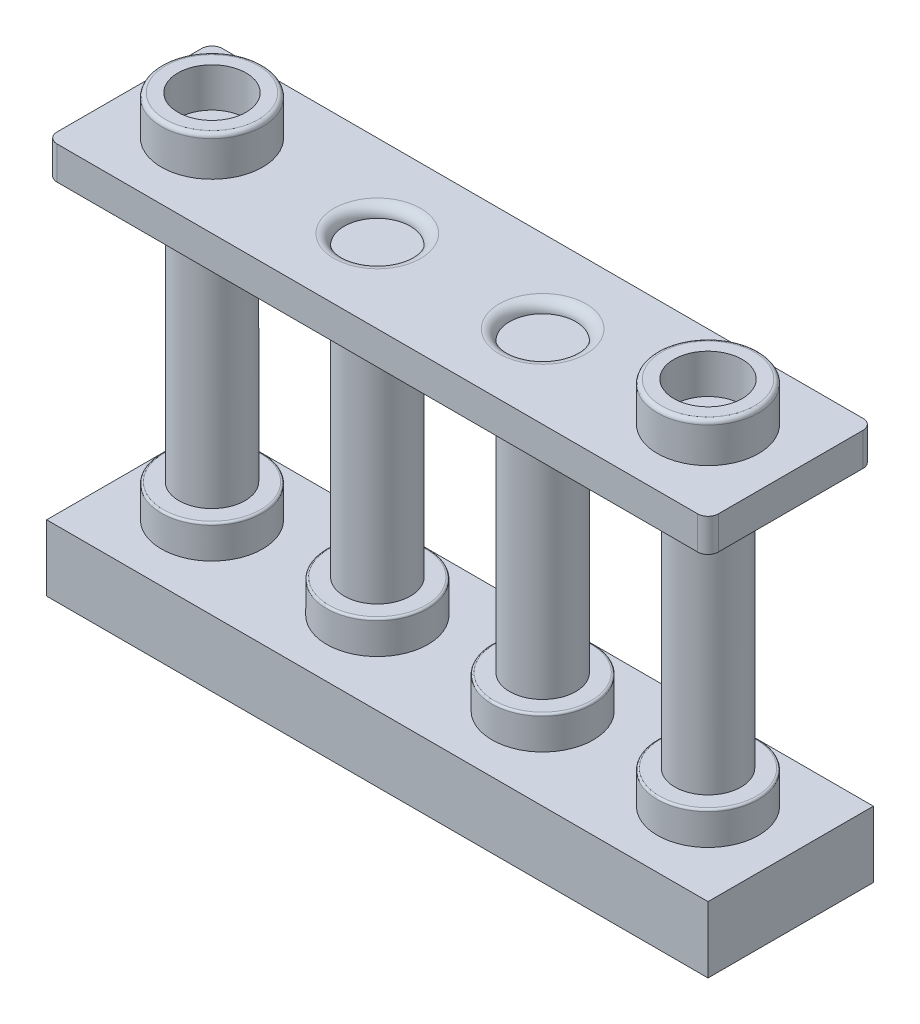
ISO-10303-21;
HEADER;
FILE_DESCRIPTION(('STEP AP214'),'2;1');
FILE_NAME('part.step','',(''),(''),'','','');
FILE_SCHEMA(('AUTOMOTIVE_DESIGN { 1 0 10303 214 1 1 1 1 }'));
ENDSEC;
DATA;
#1=APPLICATION_CONTEXT('core data for automotive mechanical design processes');
#2=APPLICATION_PROTOCOL_DEFINITION('international standard','automotive_design',2000,#1);
#3=PRODUCT_CONTEXT('',#1,'mechanical');
#4=PRODUCT('Part','Part','',(#3));
#5=PRODUCT_RELATED_PRODUCT_CATEGORY('part','',(#4));
#6=PRODUCT_DEFINITION_FORMATION('','',#4);
#7=PRODUCT_DEFINITION_CONTEXT('part definition',#1,'design');
#8=PRODUCT_DEFINITION('design','',#6,#7);
#9=PRODUCT_DEFINITION_SHAPE('','',#8);
#10=(LENGTH_UNIT() NAMED_UNIT(*) SI_UNIT(.MILLI.,.METRE.));
#11=(NAMED_UNIT(*) PLANE_ANGLE_UNIT() SI_UNIT($,.RADIAN.));
#12=(NAMED_UNIT(*) SI_UNIT($,.STERADIAN.) SOLID_ANGLE_UNIT());
#13=UNCERTAINTY_MEASURE_WITH_UNIT(LENGTH_MEASURE(1.E-05),#10,'distance_accuracy_value','');
#14=(GEOMETRIC_REPRESENTATION_CONTEXT(3) GLOBAL_UNCERTAINTY_ASSIGNED_CONTEXT((#13)) GLOBAL_UNIT_ASSIGNED_CONTEXT((#10,
#11,#12)) REPRESENTATION_CONTEXT('',''));
#15=CARTESIAN_POINT('',(0.,0.,0.));
#16=DIRECTION('',(0.,0.,1.));
#17=DIRECTION('',(1.,0.,0.));
#18=AXIS2_PLACEMENT_3D('',#15,#16,#17);
#19=CARTESIAN_POINT('',(30.4,2.1,1.6));
#20=DIRECTION('',(0.,1.,0.));
#21=DIRECTION('',(0.,0.,1.));
#22=AXIS2_PLACEMENT_3D('',#19,#20,#21);
#23=PLANE('',#22);
#24=CARTESIAN_POINT('',(28.,2.1,4.));
#25=DIRECTION('',(0.,-1.,0.));
#26=DIRECTION('',(0.,0.,-1.));
#27=AXIS2_PLACEMENT_3D('',#24,#25,#26);
#28=CIRCLE('',#27,1.3);
#29=CARTESIAN_POINT('',(28.,2.1,2.7));
#30=VERTEX_POINT('',#29);
#31=EDGE_CURVE('E410',#30,#30,#28,.T.);
#32=ORIENTED_EDGE('',*,*,#31,.F.);
#33=EDGE_LOOP('',(#32));
#34=FACE_BOUND('',#33,.T.);
#35=CARTESIAN_POINT('',(20.,2.1,4.));
#36=DIRECTION('',(0.,-1.,0.));
#37=DIRECTION('',(0.,0.,-1.));
#38=AXIS2_PLACEMENT_3D('',#35,#36,#37);
#39=CIRCLE('',#38,1.3);
#40=CARTESIAN_POINT('',(20.,2.1,2.7));
#41=VERTEX_POINT('',#40);
#42=EDGE_CURVE('E416',#41,#41,#39,.T.);
#43=ORIENTED_EDGE('',*,*,#42,.F.);
#44=EDGE_LOOP('',(#43));
#45=FACE_BOUND('',#44,.T.);
#46=CARTESIAN_POINT('',(12.,2.1,4.));
#47=DIRECTION('',(0.,-1.,0.));
#48=DIRECTION('',(0.,0.,-1.));
#49=AXIS2_PLACEMENT_3D('',#46,#47,#48);
#50=CIRCLE('',#49,1.3);
#51=CARTESIAN_POINT('',(12.,2.1,2.7));
#52=VERTEX_POINT('',#51);
#53=EDGE_CURVE('E422',#52,#52,#50,.T.);
#54=ORIENTED_EDGE('',*,*,#53,.F.);
#55=EDGE_LOOP('',(#54));
#56=FACE_BOUND('',#55,.T.);
#57=CARTESIAN_POINT('',(4.,2.1,4.));
#58=DIRECTION('',(0.,-1.,0.));
#59=DIRECTION('',(0.,0.,-1.));
#60=AXIS2_PLACEMENT_3D('',#57,#58,#59);
#61=CIRCLE('',#60,1.3);
#62=CARTESIAN_POINT('',(4.,2.1,2.7));
#63=VERTEX_POINT('',#62);
#64=EDGE_CURVE('E428',#63,#63,#61,.T.);
#65=ORIENTED_EDGE('',*,*,#64,.F.);
#66=EDGE_LOOP('',(#65));
#67=FACE_BOUND('',#66,.T.);
#68=DIRECTION('',(0.,0.,1.));
#69=VECTOR('',#68,1.);
#70=CARTESIAN_POINT('',(30.4,2.1,6.4));
#71=LINE('',#70,#69);
#72=CARTESIAN_POINT('',(30.4,2.1,1.6));
#73=VERTEX_POINT('',#72);
#74=CARTESIAN_POINT('',(30.4,2.1,6.4));
#75=VERTEX_POINT('',#74);
#76=EDGE_CURVE('E163',#73,#75,#71,.T.);
#77=ORIENTED_EDGE('',*,*,#76,.T.);
#78=DIRECTION('',(-1.,0.,0.));
#79=VECTOR('',#78,1.);
#80=CARTESIAN_POINT('',(30.4,2.1,6.4));
#81=LINE('',#80,#79);
#82=CARTESIAN_POINT('',(1.6,2.1,6.4));
#83=VERTEX_POINT('',#82);
#84=EDGE_CURVE('E169',#75,#83,#81,.T.);
#85=ORIENTED_EDGE('',*,*,#84,.T.);
#86=DIRECTION('',(0.,0.,-1.));
#87=VECTOR('',#86,1.);
#88=CARTESIAN_POINT('',(1.6,2.1,6.4));
#89=LINE('',#88,#87);
#90=CARTESIAN_POINT('',(1.6,2.1,1.6));
#91=VERTEX_POINT('',#90);
#92=EDGE_CURVE('E146',#83,#91,#89,.T.);
#93=ORIENTED_EDGE('',*,*,#92,.T.);
#94=DIRECTION('',(1.,0.,0.));
#95=VECTOR('',#94,1.);
#96=CARTESIAN_POINT('',(30.4,2.1,1.6));
#97=LINE('',#96,#95);
#98=EDGE_CURVE('E172',#91,#73,#97,.T.);
#99=ORIENTED_EDGE('',*,*,#98,.T.);
#100=EDGE_LOOP('',(#77,#85,#93,#99));
#101=FACE_BOUND('',#100,.T.);
#102=CARTESIAN_POINT('',(8.,2.1,4.));
#103=DIRECTION('',(0.,1.,0.));
#104=DIRECTION('',(0.,0.,1.));
#105=AXIS2_PLACEMENT_3D('',#102,#103,#104);
#106=CIRCLE('',#105,1.6);
#107=CARTESIAN_POINT('',(8.,2.1,5.6));
#108=VERTEX_POINT('',#107);
#109=EDGE_CURVE('E355',#108,#108,#106,.F.);
#110=ORIENTED_EDGE('',*,*,#109,.F.);
#111=EDGE_LOOP('',(#110));
#112=FACE_BOUND('',#111,.T.);
#113=CARTESIAN_POINT('',(16.,2.1,4.));
#114=DIRECTION('',(0.,1.,0.));
#115=DIRECTION('',(0.,0.,1.));
#116=AXIS2_PLACEMENT_3D('',#113,#114,#115);
#117=CIRCLE('',#116,1.6);
#118=CARTESIAN_POINT('',(16.,2.1,5.6));
#119=VERTEX_POINT('',#118);
#120=EDGE_CURVE('E358',#119,#119,#117,.F.);
#121=ORIENTED_EDGE('',*,*,#120,.F.);
#122=EDGE_LOOP('',(#121));
#123=FACE_BOUND('',#122,.T.);
#124=CARTESIAN_POINT('',(24.,2.1,4.));
#125=DIRECTION('',(0.,1.,0.));
#126=DIRECTION('',(0.,0.,1.));
#127=AXIS2_PLACEMENT_3D('',#124,#125,#126);
#128=CIRCLE('',#127,1.6);
#129=CARTESIAN_POINT('',(24.,2.1,5.6));
#130=VERTEX_POINT('',#129);
#131=EDGE_CURVE('E361',#130,#130,#128,.F.);
#132=ORIENTED_EDGE('',*,*,#131,.F.);
#133=EDGE_LOOP('',(#132));
#134=FACE_BOUND('',#133,.T.);
#135=ADVANCED_FACE('F26',(#34,#45,#56,#67,#101,#112,#123,#134),#23,.F.);
#136=CARTESIAN_POINT('',(0.,19.2,8.));
#137=DIRECTION('',(0.,-1.,0.));
#138=DIRECTION('',(0.,0.,-1.));
#139=AXIS2_PLACEMENT_3D('',#136,#137,#138);
#140=PLANE('',#139);
#141=CARTESIAN_POINT('',(12.,19.2,4.));
#142=DIRECTION('',(0.,-1.,0.));
#143=DIRECTION('',(0.,0.,-1.));
#144=AXIS2_PLACEMENT_3D('',#141,#142,#143);
#145=CIRCLE('',#144,2.1);
#146=CARTESIAN_POINT('',(12.,19.2,1.9));
#147=VERTEX_POINT('',#146);
#148=EDGE_CURVE('E11',#147,#147,#145,.T.);
#149=ORIENTED_EDGE('',*,*,#148,.T.);
#150=EDGE_LOOP('',(#149));
#151=FACE_BOUND('',#150,.T.);
#152=CARTESIAN_POINT('',(20.,19.2,4.));
#153=DIRECTION('',(0.,-1.,0.));
#154=DIRECTION('',(0.,0.,-1.));
#155=AXIS2_PLACEMENT_3D('',#152,#153,#154);
#156=CIRCLE('',#155,2.1);
#157=CARTESIAN_POINT('',(20.,19.2,1.9));
#158=VERTEX_POINT('',#157);
#159=EDGE_CURVE('E34',#158,#158,#156,.T.);
#160=ORIENTED_EDGE('',*,*,#159,.T.);
#161=EDGE_LOOP('',(#160));
#162=FACE_BOUND('',#161,.T.);
#163=CARTESIAN_POINT('',(28.,19.2,4.));
#164=DIRECTION('',(0.,-1.,0.));
#165=DIRECTION('',(0.,0.,-1.));
#166=AXIS2_PLACEMENT_3D('',#163,#164,#165);
#167=CIRCLE('',#166,2.45);
#168=CARTESIAN_POINT('',(28.,19.2,1.55));
#169=VERTEX_POINT('',#168);
#170=EDGE_CURVE('E337',#169,#169,#167,.F.);
#171=ORIENTED_EDGE('',*,*,#170,.F.);
#172=EDGE_LOOP('',(#171));
#173=FACE_BOUND('',#172,.T.);
#174=DIRECTION('',(0.,0.,-1.));
#175=VECTOR('',#174,1.);
#176=CARTESIAN_POINT('',(32.,19.2,8.));
#177=LINE('',#176,#175);
#178=CARTESIAN_POINT('',(32.,19.2,7.5));
#179=VERTEX_POINT('',#178);
#180=CARTESIAN_POINT('',(32.,19.2,0.5));
#181=VERTEX_POINT('',#180);
#182=EDGE_CURVE('E192',#179,#181,#177,.T.);
#183=ORIENTED_EDGE('',*,*,#182,.T.);
#184=CARTESIAN_POINT('',(31.5,19.2,0.5));
#185=DIRECTION('',(0.,-1.,0.));
#186=DIRECTION('',(0.,0.,-1.));
#187=AXIS2_PLACEMENT_3D('',#184,#185,#186);
#188=CIRCLE('',#187,0.5);
#189=CARTESIAN_POINT('',(31.5,19.2,0.));
#190=VERTEX_POINT('',#189);
#191=EDGE_CURVE('E234',#181,#190,#188,.F.);
#192=ORIENTED_EDGE('',*,*,#191,.T.);
#193=DIRECTION('',(-1.,0.,0.));
#194=VECTOR('',#193,1.);
#195=CARTESIAN_POINT('',(0.,19.2,0.));
#196=LINE('',#195,#194);
#197=CARTESIAN_POINT('',(0.5,19.2,0.));
#198=VERTEX_POINT('',#197);
#199=EDGE_CURVE('E196',#190,#198,#196,.T.);
#200=ORIENTED_EDGE('',*,*,#199,.T.);
#201=CARTESIAN_POINT('',(0.5,19.2,0.5));
#202=DIRECTION('',(0.,-1.,0.));
#203=DIRECTION('',(0.,0.,-1.));
#204=AXIS2_PLACEMENT_3D('',#201,#202,#203);
#205=CIRCLE('',#204,0.5);
#206=CARTESIAN_POINT('',(0.,19.2,0.5));
#207=VERTEX_POINT('',#206);
#208=EDGE_CURVE('E232',#198,#207,#205,.F.);
#209=ORIENTED_EDGE('',*,*,#208,.T.);
#210=DIRECTION('',(0.,0.,-1.));
#211=VECTOR('',#210,1.);
#212=CARTESIAN_POINT('',(0.,19.2,8.));
#213=LINE('',#212,#211);
#214=CARTESIAN_POINT('',(0.,19.2,7.5));
#215=VERTEX_POINT('',#214);
#216=EDGE_CURVE('E197',#215,#207,#213,.T.);
#217=ORIENTED_EDGE('',*,*,#216,.F.);
#218=CARTESIAN_POINT('',(0.5,19.2,7.5));
#219=DIRECTION('',(0.,-1.,0.));
#220=DIRECTION('',(0.,0.,-1.));
#221=AXIS2_PLACEMENT_3D('',#218,#219,#220);
#222=CIRCLE('',#221,0.5);
#223=CARTESIAN_POINT('',(0.5,19.2,8.));
#224=VERTEX_POINT('',#223);
#225=EDGE_CURVE('E222',#215,#224,#222,.F.);
#226=ORIENTED_EDGE('',*,*,#225,.T.);
#227=DIRECTION('',(-1.,0.,0.));
#228=VECTOR('',#227,1.);
#229=CARTESIAN_POINT('',(0.,19.2,8.));
#230=LINE('',#229,#228);
#231=CARTESIAN_POINT('',(31.5,19.2,8.));
#232=VERTEX_POINT('',#231);
#233=EDGE_CURVE('E200',#232,#224,#230,.T.);
#234=ORIENTED_EDGE('',*,*,#233,.F.);
#235=CARTESIAN_POINT('',(31.5,19.2,7.5));
#236=DIRECTION('',(0.,-1.,0.));
#237=DIRECTION('',(0.,0.,-1.));
#238=AXIS2_PLACEMENT_3D('',#235,#236,#237);
#239=CIRCLE('',#238,0.5);
#240=EDGE_CURVE('E230',#232,#179,#239,.F.);
#241=ORIENTED_EDGE('',*,*,#240,.T.);
#242=EDGE_LOOP('',(#183,#192,#200,#209,#217,#226,#234,#241));
#243=FACE_BOUND('',#242,.T.);
#244=CARTESIAN_POINT('',(4.,19.2,4.));
#245=DIRECTION('',(0.,-1.,0.));
#246=DIRECTION('',(0.,0.,-1.));
#247=AXIS2_PLACEMENT_3D('',#244,#245,#246);
#248=CIRCLE('',#247,2.45);
#249=CARTESIAN_POINT('',(4.,19.2,1.55));
#250=VERTEX_POINT('',#249);
#251=EDGE_CURVE('E340',#250,#250,#248,.F.);
#252=ORIENTED_EDGE('',*,*,#251,.F.);
#253=EDGE_LOOP('',(#252));
#254=FACE_BOUND('',#253,.T.);
#255=ADVANCED_FACE('F366',(#151,#162,#173,#243,#254),#140,.F.);
#256=CARTESIAN_POINT('',(0.,3.2,0.));
#257=DIRECTION('',(0.,-1.,0.));
#258=DIRECTION('',(1.,0.,0.));
#259=AXIS2_PLACEMENT_3D('',#256,#257,#258);
#260=PLANE('',#259);
#261=CARTESIAN_POINT('',(12.,3.2,4.));
#262=DIRECTION('',(0.,-1.,0.));
#263=DIRECTION('',(1.,0.,0.));
#264=AXIS2_PLACEMENT_3D('',#261,#262,#263);
#265=CIRCLE('',#264,2.45);
#266=CARTESIAN_POINT('',(14.45,3.2,4.));
#267=VERTEX_POINT('',#266);
#268=EDGE_CURVE('E303',#267,#267,#265,.F.);
#269=ORIENTED_EDGE('',*,*,#268,.F.);
#270=EDGE_LOOP('',(#269));
#271=FACE_BOUND('',#270,.T.);
#272=CARTESIAN_POINT('',(28.,3.2,4.));
#273=DIRECTION('',(0.,-1.,0.));
#274=DIRECTION('',(1.,0.,0.));
#275=AXIS2_PLACEMENT_3D('',#272,#273,#274);
#276=CIRCLE('',#275,2.45);
#277=CARTESIAN_POINT('',(30.45,3.2,4.));
#278=VERTEX_POINT('',#277);
#279=EDGE_CURVE('E291',#278,#278,#276,.F.);
#280=ORIENTED_EDGE('',*,*,#279,.F.);
#281=EDGE_LOOP('',(#280));
#282=FACE_BOUND('',#281,.T.);
#283=DIRECTION('',(1.,0.,0.));
#284=VECTOR('',#283,1.);
#285=CARTESIAN_POINT('',(0.,3.2,8.));
#286=LINE('',#285,#284);
#287=CARTESIAN_POINT('',(0.,3.2,8.));
#288=VERTEX_POINT('',#287);
#289=CARTESIAN_POINT('',(32.,3.2,8.));
#290=VERTEX_POINT('',#289);
#291=EDGE_CURVE('E255',#288,#290,#286,.T.);
#292=ORIENTED_EDGE('',*,*,#291,.T.);
#293=DIRECTION('',(0.,0.,1.));
#294=VECTOR('',#293,1.);
#295=CARTESIAN_POINT('',(32.,3.2,0.));
#296=LINE('',#295,#294);
#297=CARTESIAN_POINT('',(32.,3.2,0.));
#298=VERTEX_POINT('',#297);
#299=EDGE_CURVE('E49',#298,#290,#296,.T.);
#300=ORIENTED_EDGE('',*,*,#299,.F.);
#301=DIRECTION('',(1.,0.,0.));
#302=VECTOR('',#301,1.);
#303=CARTESIAN_POINT('',(0.,3.2,0.));
#304=LINE('',#303,#302);
#305=CARTESIAN_POINT('',(0.,3.2,0.));
#306=VERTEX_POINT('',#305);
#307=EDGE_CURVE('E257',#306,#298,#304,.T.);
#308=ORIENTED_EDGE('',*,*,#307,.F.);
#309=DIRECTION('',(0.,0.,1.));
#310=VECTOR('',#309,1.);
#311=CARTESIAN_POINT('',(0.,3.2,0.));
#312=LINE('',#311,#310);
#313=EDGE_CURVE('E259',#306,#288,#312,.T.);
#314=ORIENTED_EDGE('',*,*,#313,.T.);
#315=EDGE_LOOP('',(#292,#300,#308,#314));
#316=FACE_BOUND('',#315,.T.);
#317=CARTESIAN_POINT('',(20.,3.2,4.));
#318=DIRECTION('',(0.,-1.,0.));
#319=DIRECTION('',(1.,0.,0.));
#320=AXIS2_PLACEMENT_3D('',#317,#318,#319);
#321=CIRCLE('',#320,2.45);
#322=CARTESIAN_POINT('',(22.45,3.2,4.));
#323=VERTEX_POINT('',#322);
#324=EDGE_CURVE('E297',#323,#323,#321,.F.);
#325=ORIENTED_EDGE('',*,*,#324,.F.);
#326=EDGE_LOOP('',(#325));
#327=FACE_BOUND('',#326,.T.);
#328=CARTESIAN_POINT('',(4.,3.2,4.));
#329=DIRECTION('',(0.,-1.,0.));
#330=DIRECTION('',(1.,0.,0.));
#331=AXIS2_PLACEMENT_3D('',#328,#329,#330);
#332=CIRCLE('',#331,2.45);
#333=CARTESIAN_POINT('',(6.45,3.2,4.));
#334=VERTEX_POINT('',#333);
#335=EDGE_CURVE('E308',#334,#334,#332,.F.);
#336=ORIENTED_EDGE('',*,*,#335,.F.);
#337=EDGE_LOOP('',(#336));
#338=FACE_BOUND('',#337,.T.);
#339=ADVANCED_FACE('F656',(#271,#282,#316,#327,#338),#260,.F.);
#340=CARTESIAN_POINT('',(0.,17.6,0.));
#341=DIRECTION('',(0.,1.,0.));
#342=DIRECTION('',(0.,0.,1.));
#343=AXIS2_PLACEMENT_3D('',#340,#341,#342);
#344=PLANE('',#343);
#345=CARTESIAN_POINT('',(12.,17.6000000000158,4.));
#346=DIRECTION('',(0.,1.,0.));
#347=DIRECTION('',(0.,0.,1.));
#348=AXIS2_PLACEMENT_3D('',#345,#346,#347);
#349=CIRCLE('',#348,1.6);
#350=CARTESIAN_POINT('',(12.,17.6000000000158,5.6));
#351=VERTEX_POINT('',#350);
#352=EDGE_CURVE('E285',#351,#351,#349,.F.);
#353=ORIENTED_EDGE('',*,*,#352,.F.);
#354=EDGE_LOOP('',(#353));
#355=FACE_BOUND('',#354,.T.);
#356=CARTESIAN_POINT('',(28.,17.6000000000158,4.));
#357=DIRECTION('',(0.,1.,0.));
#358=DIRECTION('',(0.,0.,1.));
#359=AXIS2_PLACEMENT_3D('',#356,#357,#358);
#360=CIRCLE('',#359,1.6);
#361=CARTESIAN_POINT('',(28.,17.6000000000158,5.6));
#362=VERTEX_POINT('',#361);
#363=EDGE_CURVE('E252',#362,#362,#360,.T.);
#364=ORIENTED_EDGE('',*,*,#363,.T.);
#365=EDGE_LOOP('',(#364));
#366=FACE_BOUND('',#365,.T.);
#367=DIRECTION('',(-1.,0.,0.));
#368=VECTOR('',#367,1.);
#369=CARTESIAN_POINT('',(0.,17.6,0.));
#370=LINE('',#369,#368);
#371=CARTESIAN_POINT('',(31.5,17.6,0.));
#372=VERTEX_POINT('',#371);
#373=CARTESIAN_POINT('',(0.5,17.6,0.));
#374=VERTEX_POINT('',#373);
#375=EDGE_CURVE('E203',#372,#374,#370,.T.);
#376=ORIENTED_EDGE('',*,*,#375,.F.);
#377=CARTESIAN_POINT('',(31.5,17.6,0.5));
#378=DIRECTION('',(0.,1.,0.));
#379=DIRECTION('',(0.,0.,1.));
#380=AXIS2_PLACEMENT_3D('',#377,#378,#379);
#381=CIRCLE('',#380,0.5);
#382=CARTESIAN_POINT('',(32.,17.6,0.5));
#383=VERTEX_POINT('',#382);
#384=EDGE_CURVE('E244',#372,#383,#381,.F.);
#385=ORIENTED_EDGE('',*,*,#384,.T.);
#386=DIRECTION('',(0.,0.,1.));
#387=VECTOR('',#386,1.);
#388=CARTESIAN_POINT('',(32.,17.6,0.));
#389=LINE('',#388,#387);
#390=CARTESIAN_POINT('',(32.,17.6,7.5));
#391=VERTEX_POINT('',#390);
#392=EDGE_CURVE('E206',#383,#391,#389,.T.);
#393=ORIENTED_EDGE('',*,*,#392,.T.);
#394=CARTESIAN_POINT('',(31.5,17.6,7.5));
#395=DIRECTION('',(0.,1.,0.));
#396=DIRECTION('',(0.,0.,1.));
#397=AXIS2_PLACEMENT_3D('',#394,#395,#396);
#398=CIRCLE('',#397,0.5);
#399=CARTESIAN_POINT('',(31.5,17.6,8.));
#400=VERTEX_POINT('',#399);
#401=EDGE_CURVE('E240',#391,#400,#398,.F.);
#402=ORIENTED_EDGE('',*,*,#401,.T.);
#403=DIRECTION('',(-1.,0.,0.));
#404=VECTOR('',#403,1.);
#405=CARTESIAN_POINT('',(0.,17.6,8.));
#406=LINE('',#405,#404);
#407=CARTESIAN_POINT('',(0.5,17.6,8.));
#408=VERTEX_POINT('',#407);
#409=EDGE_CURVE('E195',#400,#408,#406,.T.);
#410=ORIENTED_EDGE('',*,*,#409,.T.);
#411=CARTESIAN_POINT('',(0.5,17.6,7.5));
#412=DIRECTION('',(0.,1.,0.));
#413=DIRECTION('',(0.,0.,1.));
#414=AXIS2_PLACEMENT_3D('',#411,#412,#413);
#415=CIRCLE('',#414,0.5);
#416=CARTESIAN_POINT('',(0.,17.6,7.5));
#417=VERTEX_POINT('',#416);
#418=EDGE_CURVE('E217',#408,#417,#415,.F.);
#419=ORIENTED_EDGE('',*,*,#418,.T.);
#420=DIRECTION('',(0.,0.,1.));
#421=VECTOR('',#420,1.);
#422=CARTESIAN_POINT('',(0.,17.6,0.));
#423=LINE('',#422,#421);
#424=CARTESIAN_POINT('',(0.,17.6,0.5));
#425=VERTEX_POINT('',#424);
#426=EDGE_CURVE('E201',#425,#417,#423,.T.);
#427=ORIENTED_EDGE('',*,*,#426,.F.);
#428=CARTESIAN_POINT('',(0.5,17.6,0.5));
#429=DIRECTION('',(0.,1.,0.));
#430=DIRECTION('',(0.,0.,1.));
#431=AXIS2_PLACEMENT_3D('',#428,#429,#430);
#432=CIRCLE('',#431,0.5);
#433=EDGE_CURVE('E242',#425,#374,#432,.F.);
#434=ORIENTED_EDGE('',*,*,#433,.T.);
#435=EDGE_LOOP('',(#376,#385,#393,#402,#410,#419,#427,#434));
#436=FACE_BOUND('',#435,.T.);
#437=CARTESIAN_POINT('',(20.,17.6000000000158,4.));
#438=DIRECTION('',(0.,1.,0.));
#439=DIRECTION('',(0.,0.,1.));
#440=AXIS2_PLACEMENT_3D('',#437,#438,#439);
#441=CIRCLE('',#440,1.6);
#442=CARTESIAN_POINT('',(20.,17.6000000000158,5.6));
#443=VERTEX_POINT('',#442);
#444=EDGE_CURVE('E282',#443,#443,#441,.F.);
#445=ORIENTED_EDGE('',*,*,#444,.F.);
#446=EDGE_LOOP('',(#445));
#447=FACE_BOUND('',#446,.T.);
#448=CARTESIAN_POINT('',(4.,17.6000000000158,4.));
#449=DIRECTION('',(0.,1.,0.));
#450=DIRECTION('',(0.,0.,1.));
#451=AXIS2_PLACEMENT_3D('',#448,#449,#450);
#452=CIRCLE('',#451,1.6);
#453=CARTESIAN_POINT('',(4.,17.6000000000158,5.6));
#454=VERTEX_POINT('',#453);
#455=EDGE_CURVE('E288',#454,#454,#452,.F.);
#456=ORIENTED_EDGE('',*,*,#455,.F.);
#457=EDGE_LOOP('',(#456));
#458=FACE_BOUND('',#457,.T.);
#459=ADVANCED_FACE('F658',(#355,#366,#436,#447,#458),#344,.F.);
#460=CARTESIAN_POINT('',(0.,0.,8.));
#461=DIRECTION('',(0.,1.,0.));
#462=DIRECTION('',(0.,0.,1.));
#463=AXIS2_PLACEMENT_3D('',#460,#461,#462);
#464=PLANE('',#463);
#465=DIRECTION('',(-1.,0.,0.));
#466=VECTOR('',#465,1.);
#467=CARTESIAN_POINT('',(30.4,0.,6.4));
#468=LINE('',#467,#466);
#469=CARTESIAN_POINT('',(30.4,0.,6.4));
#470=VERTEX_POINT('',#469);
#471=CARTESIAN_POINT('',(1.6,0.,6.4));
#472=VERTEX_POINT('',#471);
#473=EDGE_CURVE('E154',#470,#472,#468,.T.);
#474=ORIENTED_EDGE('',*,*,#473,.F.);
#475=DIRECTION('',(0.,0.,1.));
#476=VECTOR('',#475,1.);
#477=CARTESIAN_POINT('',(30.4,0.,6.4));
#478=LINE('',#477,#476);
#479=CARTESIAN_POINT('',(30.4,0.,1.6));
#480=VERTEX_POINT('',#479);
#481=EDGE_CURVE('E41',#480,#470,#478,.T.);
#482=ORIENTED_EDGE('',*,*,#481,.F.);
#483=DIRECTION('',(1.,0.,0.));
#484=VECTOR('',#483,1.);
#485=CARTESIAN_POINT('',(30.4,0.,1.6));
#486=LINE('',#485,#484);
#487=CARTESIAN_POINT('',(1.6,0.,1.6));
#488=VERTEX_POINT('',#487);
#489=EDGE_CURVE('E161',#488,#480,#486,.T.);
#490=ORIENTED_EDGE('',*,*,#489,.F.);
#491=DIRECTION('',(0.,0.,-1.));
#492=VECTOR('',#491,1.);
#493=CARTESIAN_POINT('',(1.6,0.,6.4));
#494=LINE('',#493,#492);
#495=EDGE_CURVE('E143',#472,#488,#494,.T.);
#496=ORIENTED_EDGE('',*,*,#495,.F.);
#497=EDGE_LOOP('',(#474,#482,#490,#496));
#498=FACE_BOUND('',#497,.T.);
#499=DIRECTION('',(1.,0.,0.));
#500=VECTOR('',#499,1.);
#501=CARTESIAN_POINT('',(0.,0.,0.));
#502=LINE('',#501,#500);
#503=CARTESIAN_POINT('',(0.,0.,0.));
#504=VERTEX_POINT('',#503);
#505=CARTESIAN_POINT('',(32.,0.,0.));
#506=VERTEX_POINT('',#505);
#507=EDGE_CURVE('E264',#504,#506,#502,.T.);
#508=ORIENTED_EDGE('',*,*,#507,.T.);
#509=DIRECTION('',(0.,0.,-1.));
#510=VECTOR('',#509,1.);
#511=CARTESIAN_POINT('',(32.,0.,8.));
#512=LINE('',#511,#510);
#513=CARTESIAN_POINT('',(32.,0.,8.));
#514=VERTEX_POINT('',#513);
#515=EDGE_CURVE('E276',#514,#506,#512,.T.);
#516=ORIENTED_EDGE('',*,*,#515,.F.);
#517=DIRECTION('',(1.,0.,0.));
#518=VECTOR('',#517,1.);
#519=CARTESIAN_POINT('',(0.,0.,8.));
#520=LINE('',#519,#518);
#521=CARTESIAN_POINT('',(0.,0.,8.));
#522=VERTEX_POINT('',#521);
#523=EDGE_CURVE('E271',#522,#514,#520,.T.);
#524=ORIENTED_EDGE('',*,*,#523,.F.);
#525=DIRECTION('',(0.,0.,-1.));
#526=VECTOR('',#525,1.);
#527=CARTESIAN_POINT('',(0.,0.,8.));
#528=LINE('',#527,#526);
#529=EDGE_CURVE('E279',#522,#504,#528,.T.);
#530=ORIENTED_EDGE('',*,*,#529,.T.);
#531=EDGE_LOOP('',(#508,#516,#524,#530));
#532=FACE_BOUND('',#531,.T.);
#533=ADVANCED_FACE('F158',(#498,#532),#464,.F.);
#534=CARTESIAN_POINT('',(0.,19.2,8.));
#535=DIRECTION('',(0.,0.,-1.));
#536=DIRECTION('',(-1.,0.,0.));
#537=AXIS2_PLACEMENT_3D('',#534,#535,#536);
#538=PLANE('',#537);
#539=DIRECTION('',(0.,1.,0.));
#540=VECTOR('',#539,1.);
#541=CARTESIAN_POINT('',(32.,0.,8.));
#542=LINE('',#541,#540);
#543=EDGE_CURVE('E273',#514,#290,#542,.T.);
#544=ORIENTED_EDGE('',*,*,#543,.T.);
#545=ORIENTED_EDGE('',*,*,#291,.F.);
#546=DIRECTION('',(0.,-1.,0.));
#547=VECTOR('',#546,1.);
#548=CARTESIAN_POINT('',(0.,0.,8.));
#549=LINE('',#548,#547);
#550=EDGE_CURVE('E269',#288,#522,#549,.T.);
#551=ORIENTED_EDGE('',*,*,#550,.T.);
#552=ORIENTED_EDGE('',*,*,#523,.T.);
#553=EDGE_LOOP('',(#544,#545,#551,#552));
#554=FACE_BOUND('',#553,.T.);
#555=ADVANCED_FACE('F688',(#554),#538,.F.);
#556=CARTESIAN_POINT('',(0.,19.2,0.));
#557=DIRECTION('',(0.,0.,-1.));
#558=DIRECTION('',(-1.,0.,0.));
#559=AXIS2_PLACEMENT_3D('',#556,#557,#558);
#560=PLANE('',#559);
#561=ORIENTED_EDGE('',*,*,#307,.T.);
#562=DIRECTION('',(0.,1.,0.));
#563=VECTOR('',#562,1.);
#564=CARTESIAN_POINT('',(32.,0.,0.));
#565=LINE('',#564,#563);
#566=EDGE_CURVE('E266',#506,#298,#565,.T.);
#567=ORIENTED_EDGE('',*,*,#566,.F.);
#568=ORIENTED_EDGE('',*,*,#507,.F.);
#569=DIRECTION('',(0.,-1.,0.));
#570=VECTOR('',#569,1.);
#571=CARTESIAN_POINT('',(0.,0.,0.));
#572=LINE('',#571,#570);
#573=EDGE_CURVE('E261',#306,#504,#572,.T.);
#574=ORIENTED_EDGE('',*,*,#573,.F.);
#575=EDGE_LOOP('',(#561,#567,#568,#574));
#576=FACE_BOUND('',#575,.T.);
#577=ADVANCED_FACE('F684',(#576),#560,.T.);
#578=CARTESIAN_POINT('',(32.,0.,8.));
#579=DIRECTION('',(-1.,0.,0.));
#580=DIRECTION('',(0.,-1.,0.));
#581=AXIS2_PLACEMENT_3D('',#578,#579,#580);
#582=PLANE('',#581);
#583=ORIENTED_EDGE('',*,*,#566,.T.);
#584=ORIENTED_EDGE('',*,*,#299,.T.);
#585=ORIENTED_EDGE('',*,*,#543,.F.);
#586=ORIENTED_EDGE('',*,*,#515,.T.);
#587=EDGE_LOOP('',(#583,#584,#585,#586));
#588=FACE_BOUND('',#587,.T.);
#589=ADVANCED_FACE('F687',(#588),#582,.F.);
#590=CARTESIAN_POINT('',(0.,0.,8.));
#591=DIRECTION('',(1.,0.,0.));
#592=DIRECTION('',(0.,0.,-1.));
#593=AXIS2_PLACEMENT_3D('',#590,#591,#592);
#594=PLANE('',#593);
#595=ORIENTED_EDGE('',*,*,#550,.F.);
#596=ORIENTED_EDGE('',*,*,#313,.F.);
#597=ORIENTED_EDGE('',*,*,#573,.T.);
#598=ORIENTED_EDGE('',*,*,#529,.F.);
#599=EDGE_LOOP('',(#595,#596,#597,#598));
#600=FACE_BOUND('',#599,.T.);
#601=ADVANCED_FACE('F28',(#600),#594,.F.);
#602=CARTESIAN_POINT('',(27.9999999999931,500000.,4.));
#603=DIRECTION('',(0.,-1.,0.));
#604=DIRECTION('',(1.,0.,0.));
#605=AXIS2_PLACEMENT_3D('',#602,#603,#604);
#606=CYLINDRICAL_SURFACE('',#605,1.6);
#607=CARTESIAN_POINT('',(28.,4.79999999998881,4.));
#608=DIRECTION('',(0.,1.,0.));
#609=DIRECTION('',(-1.,0.,0.));
#610=AXIS2_PLACEMENT_3D('',#607,#608,#609);
#611=CIRCLE('',#610,1.6);
#612=CARTESIAN_POINT('',(26.4,4.79999999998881,4.));
#613=VERTEX_POINT('',#612);
#614=EDGE_CURVE('E211',#613,#613,#611,.T.);
#615=ORIENTED_EDGE('',*,*,#614,.T.);
#616=EDGE_LOOP('',(#615));
#617=FACE_BOUND('',#616,.T.);
#618=ORIENTED_EDGE('',*,*,#363,.F.);
#619=EDGE_LOOP('',(#618));
#620=FACE_BOUND('',#619,.T.);
#621=ADVANCED_FACE('F676',(#617,#620),#606,.T.);
#622=CARTESIAN_POINT('',(0.,0.,8.));
#623=DIRECTION('',(1.,0.,0.));
#624=DIRECTION('',(0.,0.,-1.));
#625=AXIS2_PLACEMENT_3D('',#622,#623,#624);
#626=PLANE('',#625);
#627=ORIENTED_EDGE('',*,*,#216,.T.);
#628=DIRECTION('',(0.,-1.,0.));
#629=VECTOR('',#628,1.);
#630=CARTESIAN_POINT('',(0.,17.6,0.5));
#631=LINE('',#630,#629);
#632=EDGE_CURVE('E246',#207,#425,#631,.T.);
#633=ORIENTED_EDGE('',*,*,#632,.T.);
#634=ORIENTED_EDGE('',*,*,#426,.T.);
#635=DIRECTION('',(0.,-1.,0.));
#636=VECTOR('',#635,1.);
#637=CARTESIAN_POINT('',(0.,0.,7.5));
#638=LINE('',#637,#636);
#639=EDGE_CURVE('E220',#417,#215,#638,.F.);
#640=ORIENTED_EDGE('',*,*,#639,.T.);
#641=EDGE_LOOP('',(#627,#633,#634,#640));
#642=FACE_BOUND('',#641,.T.);
#643=ADVANCED_FACE('F672',(#642),#626,.F.);
#644=CARTESIAN_POINT('',(32.,0.,8.));
#645=DIRECTION('',(-1.,0.,0.));
#646=DIRECTION('',(0.,-1.,0.));
#647=AXIS2_PLACEMENT_3D('',#644,#645,#646);
#648=PLANE('',#647);
#649=ORIENTED_EDGE('',*,*,#392,.F.);
#650=DIRECTION('',(0.,1.,0.));
#651=VECTOR('',#650,1.);
#652=CARTESIAN_POINT('',(32.,19.2,0.5));
#653=LINE('',#652,#651);
#654=EDGE_CURVE('E227',#383,#181,#653,.T.);
#655=ORIENTED_EDGE('',*,*,#654,.T.);
#656=ORIENTED_EDGE('',*,*,#182,.F.);
#657=DIRECTION('',(0.,1.,0.));
#658=VECTOR('',#657,1.);
#659=CARTESIAN_POINT('',(32.,0.,7.5));
#660=LINE('',#659,#658);
#661=EDGE_CURVE('E225',#179,#391,#660,.F.);
#662=ORIENTED_EDGE('',*,*,#661,.T.);
#663=EDGE_LOOP('',(#649,#655,#656,#662));
#664=FACE_BOUND('',#663,.T.);
#665=ADVANCED_FACE('F665',(#664),#648,.F.);
#666=CARTESIAN_POINT('',(0.,19.2,8.));
#667=DIRECTION('',(0.,0.,-1.));
#668=DIRECTION('',(-1.,0.,0.));
#669=AXIS2_PLACEMENT_3D('',#666,#667,#668);
#670=PLANE('',#669);
#671=ORIENTED_EDGE('',*,*,#409,.F.);
#672=DIRECTION('',(0.,1.,0.));
#673=VECTOR('',#672,1.);
#674=CARTESIAN_POINT('',(31.5,19.2,8.));
#675=LINE('',#674,#673);
#676=EDGE_CURVE('E249',#400,#232,#675,.T.);
#677=ORIENTED_EDGE('',*,*,#676,.T.);
#678=ORIENTED_EDGE('',*,*,#233,.T.);
#679=DIRECTION('',(0.,-1.,0.));
#680=VECTOR('',#679,1.);
#681=CARTESIAN_POINT('',(0.5,19.2,8.));
#682=LINE('',#681,#680);
#683=EDGE_CURVE('E209',#224,#408,#682,.T.);
#684=ORIENTED_EDGE('',*,*,#683,.T.);
#685=EDGE_LOOP('',(#671,#677,#678,#684));
#686=FACE_BOUND('',#685,.T.);
#687=ADVANCED_FACE('F662',(#686),#670,.F.);
#688=CARTESIAN_POINT('',(0.,19.2,0.));
#689=DIRECTION('',(0.,0.,-1.));
#690=DIRECTION('',(-1.,0.,0.));
#691=AXIS2_PLACEMENT_3D('',#688,#689,#690);
#692=PLANE('',#691);
#693=ORIENTED_EDGE('',*,*,#199,.F.);
#694=DIRECTION('',(0.,1.,0.));
#695=VECTOR('',#694,1.);
#696=CARTESIAN_POINT('',(31.5,17.6,0.));
#697=LINE('',#696,#695);
#698=EDGE_CURVE('E238',#190,#372,#697,.F.);
#699=ORIENTED_EDGE('',*,*,#698,.T.);
#700=ORIENTED_EDGE('',*,*,#375,.T.);
#701=DIRECTION('',(0.,-1.,0.));
#702=VECTOR('',#701,1.);
#703=CARTESIAN_POINT('',(0.5,19.2,0.));
#704=LINE('',#703,#702);
#705=EDGE_CURVE('E236',#374,#198,#704,.F.);
#706=ORIENTED_EDGE('',*,*,#705,.T.);
#707=EDGE_LOOP('',(#693,#699,#700,#706));
#708=FACE_BOUND('',#707,.T.);
#709=ADVANCED_FACE('F652',(#708),#692,.T.);
#710=CARTESIAN_POINT('',(0.5,19.2,7.5));
#711=DIRECTION('',(0.,-1.,0.));
#712=DIRECTION('',(0.,0.,-1.));
#713=AXIS2_PLACEMENT_3D('',#710,#711,#712);
#714=CYLINDRICAL_SURFACE('',#713,0.5);
#715=ORIENTED_EDGE('',*,*,#225,.F.);
#716=ORIENTED_EDGE('',*,*,#639,.F.);
#717=ORIENTED_EDGE('',*,*,#418,.F.);
#718=ORIENTED_EDGE('',*,*,#683,.F.);
#719=EDGE_LOOP('',(#715,#716,#717,#718));
#720=FACE_BOUND('',#719,.T.);
#721=ADVANCED_FACE('F648',(#720),#714,.T.);
#722=CARTESIAN_POINT('',(31.5,0.,0.5));
#723=DIRECTION('',(0.,-1.,0.));
#724=DIRECTION('',(1.,0.,0.));
#725=AXIS2_PLACEMENT_3D('',#722,#723,#724);
#726=CYLINDRICAL_SURFACE('',#725,0.5);
#727=ORIENTED_EDGE('',*,*,#384,.F.);
#728=ORIENTED_EDGE('',*,*,#698,.F.);
#729=ORIENTED_EDGE('',*,*,#191,.F.);
#730=ORIENTED_EDGE('',*,*,#654,.F.);
#731=EDGE_LOOP('',(#727,#728,#729,#730));
#732=FACE_BOUND('',#731,.T.);
#733=ADVANCED_FACE('F644',(#732),#726,.T.);
#734=CARTESIAN_POINT('',(0.5,0.,0.5));
#735=DIRECTION('',(0.,1.,0.));
#736=DIRECTION('',(0.,0.,1.));
#737=AXIS2_PLACEMENT_3D('',#734,#735,#736);
#738=CYLINDRICAL_SURFACE('',#737,0.5);
#739=ORIENTED_EDGE('',*,*,#208,.F.);
#740=ORIENTED_EDGE('',*,*,#705,.F.);
#741=ORIENTED_EDGE('',*,*,#433,.F.);
#742=ORIENTED_EDGE('',*,*,#632,.F.);
#743=EDGE_LOOP('',(#739,#740,#741,#742));
#744=FACE_BOUND('',#743,.T.);
#745=ADVANCED_FACE('F640',(#744),#738,.T.);
#746=CARTESIAN_POINT('',(31.5,19.2,7.5));
#747=DIRECTION('',(0.,1.,0.));
#748=DIRECTION('',(-1.,0.,0.));
#749=AXIS2_PLACEMENT_3D('',#746,#747,#748);
#750=CYLINDRICAL_SURFACE('',#749,0.5);
#751=ORIENTED_EDGE('',*,*,#401,.F.);
#752=ORIENTED_EDGE('',*,*,#661,.F.);
#753=ORIENTED_EDGE('',*,*,#240,.F.);
#754=ORIENTED_EDGE('',*,*,#676,.F.);
#755=EDGE_LOOP('',(#751,#752,#753,#754));
#756=FACE_BOUND('',#755,.T.);
#757=ADVANCED_FACE('F636',(#756),#750,.T.);
#758=CARTESIAN_POINT('',(19.9999999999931,500000.,4.));
#759=DIRECTION('',(0.,-1.,0.));
#760=DIRECTION('',(1.,0.,0.));
#761=AXIS2_PLACEMENT_3D('',#758,#759,#760);
#762=CYLINDRICAL_SURFACE('',#761,1.6);
#763=CARTESIAN_POINT('',(20.,4.79999999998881,4.));
#764=DIRECTION('',(0.,1.,0.));
#765=DIRECTION('',(-1.,0.,0.));
#766=AXIS2_PLACEMENT_3D('',#763,#764,#765);
#767=CIRCLE('',#766,1.6);
#768=CARTESIAN_POINT('',(18.4,4.79999999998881,4.));
#769=VERTEX_POINT('',#768);
#770=EDGE_CURVE('E294',#769,#769,#767,.T.);
#771=ORIENTED_EDGE('',*,*,#770,.T.);
#772=EDGE_LOOP('',(#771));
#773=FACE_BOUND('',#772,.T.);
#774=ORIENTED_EDGE('',*,*,#444,.T.);
#775=EDGE_LOOP('',(#774));
#776=FACE_BOUND('',#775,.T.);
#777=ADVANCED_FACE('F632',(#773,#776),#762,.T.);
#778=CARTESIAN_POINT('',(11.9999999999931,500000.,4.));
#779=DIRECTION('',(0.,-1.,0.));
#780=DIRECTION('',(1.,0.,0.));
#781=AXIS2_PLACEMENT_3D('',#778,#779,#780);
#782=CYLINDRICAL_SURFACE('',#781,1.6);
#783=CARTESIAN_POINT('',(12.,4.79999999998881,4.));
#784=DIRECTION('',(0.,1.,0.));
#785=DIRECTION('',(-1.,0.,0.));
#786=AXIS2_PLACEMENT_3D('',#783,#784,#785);
#787=CIRCLE('',#786,1.6);
#788=CARTESIAN_POINT('',(10.4,4.79999999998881,4.));
#789=VERTEX_POINT('',#788);
#790=EDGE_CURVE('E300',#789,#789,#787,.T.);
#791=ORIENTED_EDGE('',*,*,#790,.T.);
#792=EDGE_LOOP('',(#791));
#793=FACE_BOUND('',#792,.T.);
#794=ORIENTED_EDGE('',*,*,#352,.T.);
#795=EDGE_LOOP('',(#794));
#796=FACE_BOUND('',#795,.T.);
#797=ADVANCED_FACE('F628',(#793,#796),#782,.T.);
#798=CARTESIAN_POINT('',(3.99999999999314,500000.,4.));
#799=DIRECTION('',(0.,-1.,0.));
#800=DIRECTION('',(1.,0.,0.));
#801=AXIS2_PLACEMENT_3D('',#798,#799,#800);
#802=CYLINDRICAL_SURFACE('',#801,1.6);
#803=CARTESIAN_POINT('',(4.,4.79999999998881,4.));
#804=DIRECTION('',(0.,1.,0.));
#805=DIRECTION('',(-1.,0.,0.));
#806=AXIS2_PLACEMENT_3D('',#803,#804,#805);
#807=CIRCLE('',#806,1.6);
#808=CARTESIAN_POINT('',(2.4,4.79999999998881,4.));
#809=VERTEX_POINT('',#808);
#810=EDGE_CURVE('E191',#809,#809,#807,.T.);
#811=ORIENTED_EDGE('',*,*,#810,.T.);
#812=EDGE_LOOP('',(#811));
#813=FACE_BOUND('',#812,.T.);
#814=ORIENTED_EDGE('',*,*,#455,.T.);
#815=EDGE_LOOP('',(#814));
#816=FACE_BOUND('',#815,.T.);
#817=ADVANCED_FACE('F621',(#813,#816),#802,.T.);
#818=CARTESIAN_POINT('',(28.,4.8,4.));
#819=DIRECTION('',(0.,1.,0.));
#820=DIRECTION('',(-1.,0.,0.));
#821=AXIS2_PLACEMENT_3D('',#818,#819,#820);
#822=PLANE('',#821);
#823=CARTESIAN_POINT('',(28.,4.8,4.));
#824=DIRECTION('',(0.,1.,0.));
#825=DIRECTION('',(-1.,0.,0.));
#826=AXIS2_PLACEMENT_3D('',#823,#824,#825);
#827=CIRCLE('',#826,2.35);
#828=CARTESIAN_POINT('',(25.65,4.8,4.));
#829=VERTEX_POINT('',#828);
#830=EDGE_CURVE('E331',#829,#829,#827,.T.);
#831=ORIENTED_EDGE('',*,*,#830,.T.);
#832=EDGE_LOOP('',(#831));
#833=FACE_BOUND('',#832,.T.);
#834=ORIENTED_EDGE('',*,*,#614,.F.);
#835=EDGE_LOOP('',(#834));
#836=FACE_BOUND('',#835,.T.);
#837=ADVANCED_FACE('F618',(#833,#836),#822,.T.);
#838=CARTESIAN_POINT('',(28.,4.8,4.));
#839=DIRECTION('',(0.,-1.,0.));
#840=DIRECTION('',(1.,0.,0.));
#841=AXIS2_PLACEMENT_3D('',#838,#839,#840);
#842=CYLINDRICAL_SURFACE('',#841,2.45);
#843=CARTESIAN_POINT('',(28.,4.7,4.));
#844=DIRECTION('',(0.,1.,0.));
#845=DIRECTION('',(-1.,0.,0.));
#846=AXIS2_PLACEMENT_3D('',#843,#844,#845);
#847=CIRCLE('',#846,2.45);
#848=CARTESIAN_POINT('',(25.55,4.7,4.));
#849=VERTEX_POINT('',#848);
#850=EDGE_CURVE('E334',#849,#849,#847,.F.);
#851=ORIENTED_EDGE('',*,*,#850,.T.);
#852=EDGE_LOOP('',(#851));
#853=FACE_BOUND('',#852,.T.);
#854=ORIENTED_EDGE('',*,*,#279,.T.);
#855=EDGE_LOOP('',(#854));
#856=FACE_BOUND('',#855,.T.);
#857=ADVANCED_FACE('F613',(#853,#856),#842,.T.);
#858=CARTESIAN_POINT('',(20.,4.8,4.));
#859=DIRECTION('',(0.,1.,0.));
#860=DIRECTION('',(-1.,0.,0.));
#861=AXIS2_PLACEMENT_3D('',#858,#859,#860);
#862=PLANE('',#861);
#863=CARTESIAN_POINT('',(20.,4.8,4.));
#864=DIRECTION('',(0.,1.,0.));
#865=DIRECTION('',(-1.,0.,0.));
#866=AXIS2_PLACEMENT_3D('',#863,#864,#865);
#867=CIRCLE('',#866,2.35);
#868=CARTESIAN_POINT('',(17.65,4.8,4.));
#869=VERTEX_POINT('',#868);
#870=EDGE_CURVE('E325',#869,#869,#867,.T.);
#871=ORIENTED_EDGE('',*,*,#870,.T.);
#872=EDGE_LOOP('',(#871));
#873=FACE_BOUND('',#872,.T.);
#874=ORIENTED_EDGE('',*,*,#770,.F.);
#875=EDGE_LOOP('',(#874));
#876=FACE_BOUND('',#875,.T.);
#877=ADVANCED_FACE('F610',(#873,#876),#862,.T.);
#878=CARTESIAN_POINT('',(20.,4.8,4.));
#879=DIRECTION('',(0.,-1.,0.));
#880=DIRECTION('',(1.,0.,0.));
#881=AXIS2_PLACEMENT_3D('',#878,#879,#880);
#882=CYLINDRICAL_SURFACE('',#881,2.45);
#883=CARTESIAN_POINT('',(20.,4.7,4.));
#884=DIRECTION('',(0.,1.,0.));
#885=DIRECTION('',(-1.,0.,0.));
#886=AXIS2_PLACEMENT_3D('',#883,#884,#885);
#887=CIRCLE('',#886,2.45);
#888=CARTESIAN_POINT('',(17.55,4.7,4.));
#889=VERTEX_POINT('',#888);
#890=EDGE_CURVE('E328',#889,#889,#887,.F.);
#891=ORIENTED_EDGE('',*,*,#890,.T.);
#892=EDGE_LOOP('',(#891));
#893=FACE_BOUND('',#892,.T.);
#894=ORIENTED_EDGE('',*,*,#324,.T.);
#895=EDGE_LOOP('',(#894));
#896=FACE_BOUND('',#895,.T.);
#897=ADVANCED_FACE('F605',(#893,#896),#882,.T.);
#898=CARTESIAN_POINT('',(12.,4.8,4.));
#899=DIRECTION('',(0.,1.,0.));
#900=DIRECTION('',(-1.,0.,0.));
#901=AXIS2_PLACEMENT_3D('',#898,#899,#900);
#902=PLANE('',#901);
#903=CARTESIAN_POINT('',(12.,4.8,4.));
#904=DIRECTION('',(0.,1.,0.));
#905=DIRECTION('',(-1.,0.,0.));
#906=AXIS2_PLACEMENT_3D('',#903,#904,#905);
#907=CIRCLE('',#906,2.35);
#908=CARTESIAN_POINT('',(9.65,4.8,4.));
#909=VERTEX_POINT('',#908);
#910=EDGE_CURVE('E319',#909,#909,#907,.T.);
#911=ORIENTED_EDGE('',*,*,#910,.T.);
#912=EDGE_LOOP('',(#911));
#913=FACE_BOUND('',#912,.T.);
#914=ORIENTED_EDGE('',*,*,#790,.F.);
#915=EDGE_LOOP('',(#914));
#916=FACE_BOUND('',#915,.T.);
#917=ADVANCED_FACE('F602',(#913,#916),#902,.T.);
#918=CARTESIAN_POINT('',(12.,4.8,4.));
#919=DIRECTION('',(0.,-1.,0.));
#920=DIRECTION('',(1.,0.,0.));
#921=AXIS2_PLACEMENT_3D('',#918,#919,#920);
#922=CYLINDRICAL_SURFACE('',#921,2.45);
#923=CARTESIAN_POINT('',(12.,4.7,4.));
#924=DIRECTION('',(0.,1.,0.));
#925=DIRECTION('',(-1.,0.,0.));
#926=AXIS2_PLACEMENT_3D('',#923,#924,#925);
#927=CIRCLE('',#926,2.45);
#928=CARTESIAN_POINT('',(9.55,4.7,4.));
#929=VERTEX_POINT('',#928);
#930=EDGE_CURVE('E322',#929,#929,#927,.F.);
#931=ORIENTED_EDGE('',*,*,#930,.T.);
#932=EDGE_LOOP('',(#931));
#933=FACE_BOUND('',#932,.T.);
#934=ORIENTED_EDGE('',*,*,#268,.T.);
#935=EDGE_LOOP('',(#934));
#936=FACE_BOUND('',#935,.T.);
#937=ADVANCED_FACE('F597',(#933,#936),#922,.T.);
#938=CARTESIAN_POINT('',(4.,4.8,4.));
#939=DIRECTION('',(0.,1.,0.));
#940=DIRECTION('',(-1.,0.,0.));
#941=AXIS2_PLACEMENT_3D('',#938,#939,#940);
#942=PLANE('',#941);
#943=CARTESIAN_POINT('',(4.,4.8,4.));
#944=DIRECTION('',(0.,1.,0.));
#945=DIRECTION('',(-1.,0.,0.));
#946=AXIS2_PLACEMENT_3D('',#943,#944,#945);
#947=CIRCLE('',#946,2.35);
#948=CARTESIAN_POINT('',(1.65,4.8,4.));
#949=VERTEX_POINT('',#948);
#950=EDGE_CURVE('E313',#949,#949,#947,.T.);
#951=ORIENTED_EDGE('',*,*,#950,.T.);
#952=EDGE_LOOP('',(#951));
#953=FACE_BOUND('',#952,.T.);
#954=ORIENTED_EDGE('',*,*,#810,.F.);
#955=EDGE_LOOP('',(#954));
#956=FACE_BOUND('',#955,.T.);
#957=ADVANCED_FACE('F594',(#953,#956),#942,.T.);
#958=CARTESIAN_POINT('',(4.,4.8,4.));
#959=DIRECTION('',(0.,-1.,0.));
#960=DIRECTION('',(1.,0.,0.));
#961=AXIS2_PLACEMENT_3D('',#958,#959,#960);
#962=CYLINDRICAL_SURFACE('',#961,2.45);
#963=CARTESIAN_POINT('',(4.,4.7,4.));
#964=DIRECTION('',(0.,1.,0.));
#965=DIRECTION('',(-1.,0.,0.));
#966=AXIS2_PLACEMENT_3D('',#963,#964,#965);
#967=CIRCLE('',#966,2.45);
#968=CARTESIAN_POINT('',(1.55,4.7,4.));
#969=VERTEX_POINT('',#968);
#970=EDGE_CURVE('E316',#969,#969,#967,.F.);
#971=ORIENTED_EDGE('',*,*,#970,.T.);
#972=EDGE_LOOP('',(#971));
#973=FACE_BOUND('',#972,.T.);
#974=ORIENTED_EDGE('',*,*,#335,.T.);
#975=EDGE_LOOP('',(#974));
#976=FACE_BOUND('',#975,.T.);
#977=ADVANCED_FACE('F592',(#973,#976),#962,.T.);
#978=CARTESIAN_POINT('',(4.,4.7,4.));
#979=DIRECTION('',(0.,1.,0.));
#980=DIRECTION('',(-1.,0.,0.));
#981=AXIS2_PLACEMENT_3D('',#978,#979,#980);
#982=TOROIDAL_SURFACE('',#981,2.35,0.1);
#983=ORIENTED_EDGE('',*,*,#970,.F.);
#984=EDGE_LOOP('',(#983));
#985=FACE_BOUND('',#984,.T.);
#986=ORIENTED_EDGE('',*,*,#950,.F.);
#987=EDGE_LOOP('',(#986));
#988=FACE_BOUND('',#987,.T.);
#989=ADVANCED_FACE('F588',(#985,#988),#982,.T.);
#990=CARTESIAN_POINT('',(12.,4.7,4.));
#991=DIRECTION('',(0.,1.,0.));
#992=DIRECTION('',(-1.,0.,0.));
#993=AXIS2_PLACEMENT_3D('',#990,#991,#992);
#994=TOROIDAL_SURFACE('',#993,2.35,0.1);
#995=ORIENTED_EDGE('',*,*,#930,.F.);
#996=EDGE_LOOP('',(#995));
#997=FACE_BOUND('',#996,.T.);
#998=ORIENTED_EDGE('',*,*,#910,.F.);
#999=EDGE_LOOP('',(#998));
#1000=FACE_BOUND('',#999,.T.);
#1001=ADVANCED_FACE('F584',(#997,#1000),#994,.T.);
#1002=CARTESIAN_POINT('',(20.,4.7,4.));
#1003=DIRECTION('',(0.,1.,0.));
#1004=DIRECTION('',(-1.,0.,0.));
#1005=AXIS2_PLACEMENT_3D('',#1002,#1003,#1004);
#1006=TOROIDAL_SURFACE('',#1005,2.35,0.1);
#1007=ORIENTED_EDGE('',*,*,#890,.F.);
#1008=EDGE_LOOP('',(#1007));
#1009=FACE_BOUND('',#1008,.T.);
#1010=ORIENTED_EDGE('',*,*,#870,.F.);
#1011=EDGE_LOOP('',(#1010));
#1012=FACE_BOUND('',#1011,.T.);
#1013=ADVANCED_FACE('F580',(#1009,#1012),#1006,.T.);
#1014=CARTESIAN_POINT('',(28.,4.7,4.));
#1015=DIRECTION('',(0.,1.,0.));
#1016=DIRECTION('',(-1.,0.,0.));
#1017=AXIS2_PLACEMENT_3D('',#1014,#1015,#1016);
#1018=TOROIDAL_SURFACE('',#1017,2.35,0.1);
#1019=ORIENTED_EDGE('',*,*,#850,.F.);
#1020=EDGE_LOOP('',(#1019));
#1021=FACE_BOUND('',#1020,.T.);
#1022=ORIENTED_EDGE('',*,*,#830,.F.);
#1023=EDGE_LOOP('',(#1022));
#1024=FACE_BOUND('',#1023,.T.);
#1025=ADVANCED_FACE('F576',(#1021,#1024),#1018,.T.);
#1026=CARTESIAN_POINT('',(28.,21.1,4.));
#1027=DIRECTION('',(0.,-1.,0.));
#1028=DIRECTION('',(0.,0.,-1.));
#1029=AXIS2_PLACEMENT_3D('',#1026,#1027,#1028);
#1030=CYLINDRICAL_SURFACE('',#1029,2.45);
#1031=CARTESIAN_POINT('',(28.,20.9,4.));
#1032=DIRECTION('',(0.,1.,0.));
#1033=DIRECTION('',(0.,0.,1.));
#1034=AXIS2_PLACEMENT_3D('',#1031,#1032,#1033);
#1035=CIRCLE('',#1034,2.45);
#1036=CARTESIAN_POINT('',(28.,20.9,1.55));
#1037=VERTEX_POINT('',#1036);
#1038=EDGE_CURVE('E352',#1037,#1037,#1035,.F.);
#1039=CARTESIAN_POINT('',(28.,20.9,1.55));
#1040=CARTESIAN_POINT('',(28.,20.8822916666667,1.55));
#1041=CARTESIAN_POINT('',(28.,20.8645833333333,1.55));
#1042=CARTESIAN_POINT('',(28.,20.8291666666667,1.55));
#1043=CARTESIAN_POINT('',(28.,20.8114583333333,1.55));
#1044=CARTESIAN_POINT('',(28.,20.7760416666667,1.55));
#1045=CARTESIAN_POINT('',(28.,20.7583333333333,1.55));
#1046=CARTESIAN_POINT('',(28.,20.7229166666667,1.55));
#1047=CARTESIAN_POINT('',(28.,20.7052083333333,1.55));
#1048=CARTESIAN_POINT('',(28.,20.6697916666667,1.55));
#1049=CARTESIAN_POINT('',(28.,20.6520833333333,1.55));
#1050=CARTESIAN_POINT('',(28.,20.6166666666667,1.55));
#1051=CARTESIAN_POINT('',(28.,20.5989583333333,1.55));
#1052=CARTESIAN_POINT('',(28.,20.5635416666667,1.55));
#1053=CARTESIAN_POINT('',(28.,20.5458333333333,1.55));
#1054=CARTESIAN_POINT('',(28.,20.5104166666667,1.55));
#1055=CARTESIAN_POINT('',(28.,20.4927083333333,1.55));
#1056=CARTESIAN_POINT('',(28.,20.4572916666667,1.55));
#1057=CARTESIAN_POINT('',(28.,20.4395833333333,1.55));
#1058=CARTESIAN_POINT('',(28.,20.4041666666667,1.55));
#1059=CARTESIAN_POINT('',(28.,20.3864583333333,1.55));
#1060=CARTESIAN_POINT('',(28.,20.3510416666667,1.55));
#1061=CARTESIAN_POINT('',(28.,20.3333333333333,1.55));
#1062=CARTESIAN_POINT('',(28.,20.2979166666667,1.55));
#1063=CARTESIAN_POINT('',(28.,20.2802083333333,1.55));
#1064=CARTESIAN_POINT('',(28.,20.2447916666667,1.55));
#1065=CARTESIAN_POINT('',(28.,20.2270833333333,1.55));
#1066=CARTESIAN_POINT('',(28.,20.1916666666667,1.55));
#1067=CARTESIAN_POINT('',(28.,20.1739583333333,1.55));
#1068=CARTESIAN_POINT('',(28.,20.1385416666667,1.55));
#1069=CARTESIAN_POINT('',(28.,20.1208333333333,1.55));
#1070=CARTESIAN_POINT('',(28.,20.0854166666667,1.55));
#1071=CARTESIAN_POINT('',(28.,20.0677083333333,1.55));
#1072=CARTESIAN_POINT('',(28.,20.0322916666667,1.55));
#1073=CARTESIAN_POINT('',(28.,20.0145833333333,1.55));
#1074=CARTESIAN_POINT('',(28.,19.9791666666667,1.55));
#1075=CARTESIAN_POINT('',(28.,19.9614583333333,1.55));
#1076=CARTESIAN_POINT('',(28.,19.9260416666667,1.55));
#1077=CARTESIAN_POINT('',(28.,19.9083333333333,1.55));
#1078=CARTESIAN_POINT('',(28.,19.8729166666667,1.55));
#1079=CARTESIAN_POINT('',(28.,19.8552083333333,1.55));
#1080=CARTESIAN_POINT('',(28.,19.8197916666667,1.55));
#1081=CARTESIAN_POINT('',(28.,19.8020833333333,1.55));
#1082=CARTESIAN_POINT('',(28.,19.7666666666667,1.55));
#1083=CARTESIAN_POINT('',(28.,19.7489583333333,1.55));
#1084=CARTESIAN_POINT('',(28.,19.7135416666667,1.55));
#1085=CARTESIAN_POINT('',(28.,19.6958333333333,1.55));
#1086=CARTESIAN_POINT('',(28.,19.6604166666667,1.55));
#1087=CARTESIAN_POINT('',(28.,19.6427083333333,1.55));
#1088=CARTESIAN_POINT('',(28.,19.6072916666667,1.55));
#1089=CARTESIAN_POINT('',(28.,19.5895833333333,1.55));
#1090=CARTESIAN_POINT('',(28.,19.5541666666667,1.55));
#1091=CARTESIAN_POINT('',(28.,19.5364583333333,1.55));
#1092=CARTESIAN_POINT('',(28.,19.5010416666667,1.55));
#1093=CARTESIAN_POINT('',(28.,19.4833333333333,1.55));
#1094=CARTESIAN_POINT('',(28.,19.4479166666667,1.55));
#1095=CARTESIAN_POINT('',(28.,19.4302083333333,1.55));
#1096=CARTESIAN_POINT('',(28.,19.3947916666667,1.55));
#1097=CARTESIAN_POINT('',(28.,19.3770833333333,1.55));
#1098=CARTESIAN_POINT('',(28.,19.3416666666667,1.55));
#1099=CARTESIAN_POINT('',(28.,19.3239583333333,1.55));
#1100=CARTESIAN_POINT('',(28.,19.2885416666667,1.55));
#1101=CARTESIAN_POINT('',(28.,19.2708333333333,1.55));
#1102=CARTESIAN_POINT('',(28.,19.2354166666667,1.55));
#1103=CARTESIAN_POINT('',(28.,19.2177083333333,1.55));
#1104=CARTESIAN_POINT('',(28.,19.2,1.55));
#1105=B_SPLINE_CURVE_WITH_KNOTS('',3,(#1039,#1040,#1041,#1042,#1043,#1044,#1045,#1046,#1047,
#1048,#1049,#1050,#1051,#1052,#1053,#1054,#1055,#1056,#1057,#1058,#1059,#1060,#1061,#1062,#1063,
#1064,#1065,#1066,#1067,#1068,#1069,#1070,#1071,#1072,#1073,#1074,#1075,#1076,#1077,#1078,#1079,
#1080,#1081,#1082,#1083,#1084,#1085,#1086,#1087,#1088,#1089,#1090,#1091,#1092,#1093,#1094,#1095,
#1096,#1097,#1098,#1099,#1100,#1101,#1102,#1103,#1104),.UNSPECIFIED.,.F.,.F.,(4,2,2,2,2,2,2,2,2,
2,2,2,2,2,2,2,2,2,2,2,2,2,2,2,2,2,2,2,2,2,2,2,4),(0.,0.0531250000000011,0.106250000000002,
0.159375,0.212500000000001,0.265625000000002,0.31875,0.371875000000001,0.425000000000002,
0.478124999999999,0.53125,0.584375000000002,0.637499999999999,0.690625,0.743750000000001,
0.796874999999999,0.85,0.903125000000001,0.956249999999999,1.009375,1.0625,1.115625,1.16875,
1.221875,1.275,1.328125,1.38125,1.434375,1.4875,1.540625,1.59375,1.646875,1.7),.UNSPECIFIED.);
#1106=EDGE_CURVE('BSEAM572',#1037,#169,#1105,.T.);
#1107=ORIENTED_EDGE('',*,*,#1038,.T.);
#1108=ORIENTED_EDGE('',*,*,#170,.T.);
#1109=ORIENTED_EDGE('',*,*,#1106,.T.);
#1110=ORIENTED_EDGE('',*,*,#1106,.F.);
#1111=EDGE_LOOP('',(#1107,#1109,#1108,#1110));
#1112=FACE_BOUND('',#1111,.T.);
#1113=ADVANCED_FACE('F572',(#1112),#1030,.T.);
#1114=CARTESIAN_POINT('',(28.,21.1,4.));
#1115=DIRECTION('',(0.,1.,0.));
#1116=DIRECTION('',(0.,0.,1.));
#1117=AXIS2_PLACEMENT_3D('',#1114,#1115,#1116);
#1118=PLANE('',#1117);
#1119=CARTESIAN_POINT('',(28.,21.1,4.));
#1120=DIRECTION('',(0.,1.,0.));
#1121=DIRECTION('',(0.,0.,1.));
#1122=AXIS2_PLACEMENT_3D('',#1119,#1120,#1121);
#1123=CIRCLE('',#1122,1.65);
#1124=CARTESIAN_POINT('',(28.,21.1,5.65));
#1125=VERTEX_POINT('',#1124);
#1126=EDGE_CURVE('E185',#1125,#1125,#1123,.T.);
#1127=ORIENTED_EDGE('',*,*,#1126,.F.);
#1128=EDGE_LOOP('',(#1127));
#1129=FACE_BOUND('',#1128,.T.);
#1130=CARTESIAN_POINT('',(28.,21.1,4.));
#1131=DIRECTION('',(0.,1.,0.));
#1132=DIRECTION('',(0.,0.,1.));
#1133=AXIS2_PLACEMENT_3D('',#1130,#1131,#1132);
#1134=CIRCLE('',#1133,2.25);
#1135=CARTESIAN_POINT('',(28.,21.1,6.25));
#1136=VERTEX_POINT('',#1135);
#1137=EDGE_CURVE('E349',#1136,#1136,#1134,.T.);
#1138=ORIENTED_EDGE('',*,*,#1137,.T.);
#1139=EDGE_LOOP('',(#1138));
#1140=FACE_BOUND('',#1139,.T.);
#1141=ADVANCED_FACE('F568',(#1129,#1140),#1118,.T.);
#1142=CARTESIAN_POINT('',(4.,21.1,4.));
#1143=DIRECTION('',(0.,-1.,0.));
#1144=DIRECTION('',(0.,0.,-1.));
#1145=AXIS2_PLACEMENT_3D('',#1142,#1143,#1144);
#1146=CYLINDRICAL_SURFACE('',#1145,2.45);
#1147=CARTESIAN_POINT('',(4.,20.9,4.));
#1148=DIRECTION('',(0.,1.,0.));
#1149=DIRECTION('',(0.,0.,1.));
#1150=AXIS2_PLACEMENT_3D('',#1147,#1148,#1149);
#1151=CIRCLE('',#1150,2.45);
#1152=CARTESIAN_POINT('',(4.,20.9,1.55));
#1153=VERTEX_POINT('',#1152);
#1154=EDGE_CURVE('E346',#1153,#1153,#1151,.F.);
#1155=CARTESIAN_POINT('',(4.,20.9,1.55));
#1156=CARTESIAN_POINT('',(4.,20.8822916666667,1.55));
#1157=CARTESIAN_POINT('',(4.,20.8645833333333,1.55));
#1158=CARTESIAN_POINT('',(4.,20.8291666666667,1.55));
#1159=CARTESIAN_POINT('',(4.,20.8114583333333,1.55));
#1160=CARTESIAN_POINT('',(4.,20.7760416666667,1.55));
#1161=CARTESIAN_POINT('',(4.,20.7583333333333,1.55));
#1162=CARTESIAN_POINT('',(4.,20.7229166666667,1.55));
#1163=CARTESIAN_POINT('',(4.,20.7052083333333,1.55));
#1164=CARTESIAN_POINT('',(4.,20.6697916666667,1.55));
#1165=CARTESIAN_POINT('',(4.,20.6520833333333,1.55));
#1166=CARTESIAN_POINT('',(4.,20.6166666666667,1.55));
#1167=CARTESIAN_POINT('',(4.,20.5989583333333,1.55));
#1168=CARTESIAN_POINT('',(4.,20.5635416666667,1.55));
#1169=CARTESIAN_POINT('',(4.,20.5458333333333,1.55));
#1170=CARTESIAN_POINT('',(4.,20.5104166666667,1.55));
#1171=CARTESIAN_POINT('',(4.,20.4927083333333,1.55));
#1172=CARTESIAN_POINT('',(4.,20.4572916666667,1.55));
#1173=CARTESIAN_POINT('',(4.,20.4395833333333,1.55));
#1174=CARTESIAN_POINT('',(4.,20.4041666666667,1.55));
#1175=CARTESIAN_POINT('',(4.,20.3864583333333,1.55));
#1176=CARTESIAN_POINT('',(4.,20.3510416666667,1.55));
#1177=CARTESIAN_POINT('',(4.,20.3333333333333,1.55));
#1178=CARTESIAN_POINT('',(4.,20.2979166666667,1.55));
#1179=CARTESIAN_POINT('',(4.,20.2802083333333,1.55));
#1180=CARTESIAN_POINT('',(4.,20.2447916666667,1.55));
#1181=CARTESIAN_POINT('',(4.,20.2270833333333,1.55));
#1182=CARTESIAN_POINT('',(4.,20.1916666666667,1.55));
#1183=CARTESIAN_POINT('',(4.,20.1739583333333,1.55));
#1184=CARTESIAN_POINT('',(4.,20.1385416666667,1.55));
#1185=CARTESIAN_POINT('',(4.,20.1208333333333,1.55));
#1186=CARTESIAN_POINT('',(4.,20.0854166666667,1.55));
#1187=CARTESIAN_POINT('',(4.,20.0677083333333,1.55));
#1188=CARTESIAN_POINT('',(4.,20.0322916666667,1.55));
#1189=CARTESIAN_POINT('',(4.,20.0145833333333,1.55));
#1190=CARTESIAN_POINT('',(4.,19.9791666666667,1.55));
#1191=CARTESIAN_POINT('',(4.,19.9614583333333,1.55));
#1192=CARTESIAN_POINT('',(4.,19.9260416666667,1.55));
#1193=CARTESIAN_POINT('',(4.,19.9083333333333,1.55));
#1194=CARTESIAN_POINT('',(4.,19.8729166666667,1.55));
#1195=CARTESIAN_POINT('',(4.,19.8552083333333,1.55));
#1196=CARTESIAN_POINT('',(4.,19.8197916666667,1.55));
#1197=CARTESIAN_POINT('',(4.,19.8020833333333,1.55));
#1198=CARTESIAN_POINT('',(4.,19.7666666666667,1.55));
#1199=CARTESIAN_POINT('',(4.,19.7489583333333,1.55));
#1200=CARTESIAN_POINT('',(4.,19.7135416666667,1.55));
#1201=CARTESIAN_POINT('',(4.,19.6958333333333,1.55));
#1202=CARTESIAN_POINT('',(4.,19.6604166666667,1.55));
#1203=CARTESIAN_POINT('',(4.,19.6427083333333,1.55));
#1204=CARTESIAN_POINT('',(4.,19.6072916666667,1.55));
#1205=CARTESIAN_POINT('',(4.,19.5895833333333,1.55));
#1206=CARTESIAN_POINT('',(4.,19.5541666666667,1.55));
#1207=CARTESIAN_POINT('',(4.,19.5364583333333,1.55));
#1208=CARTESIAN_POINT('',(4.,19.5010416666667,1.55));
#1209=CARTESIAN_POINT('',(4.,19.4833333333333,1.55));
#1210=CARTESIAN_POINT('',(4.,19.4479166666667,1.55));
#1211=CARTESIAN_POINT('',(4.,19.4302083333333,1.55));
#1212=CARTESIAN_POINT('',(4.,19.3947916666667,1.55));
#1213=CARTESIAN_POINT('',(4.,19.3770833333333,1.55));
#1214=CARTESIAN_POINT('',(4.,19.3416666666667,1.55));
#1215=CARTESIAN_POINT('',(4.,19.3239583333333,1.55));
#1216=CARTESIAN_POINT('',(4.,19.2885416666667,1.55));
#1217=CARTESIAN_POINT('',(4.,19.2708333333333,1.55));
#1218=CARTESIAN_POINT('',(4.,19.2354166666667,1.55));
#1219=CARTESIAN_POINT('',(4.,19.2177083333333,1.55));
#1220=CARTESIAN_POINT('',(4.,19.2,1.55));
#1221=B_SPLINE_CURVE_WITH_KNOTS('',3,(#1155,#1156,#1157,#1158,#1159,#1160,#1161,#1162,#1163,
#1164,#1165,#1166,#1167,#1168,#1169,#1170,#1171,#1172,#1173,#1174,#1175,#1176,#1177,#1178,#1179,
#1180,#1181,#1182,#1183,#1184,#1185,#1186,#1187,#1188,#1189,#1190,#1191,#1192,#1193,#1194,#1195,
#1196,#1197,#1198,#1199,#1200,#1201,#1202,#1203,#1204,#1205,#1206,#1207,#1208,#1209,#1210,#1211,
#1212,#1213,#1214,#1215,#1216,#1217,#1218,#1219,#1220),.UNSPECIFIED.,.F.,.F.,(4,2,2,2,2,2,2,2,2,
2,2,2,2,2,2,2,2,2,2,2,2,2,2,2,2,2,2,2,2,2,2,2,4),(0.,0.0531250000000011,0.106250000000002,
0.159375,0.212500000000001,0.265625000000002,0.31875,0.371875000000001,0.425000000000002,
0.478124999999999,0.53125,0.584375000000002,0.637499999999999,0.690625,0.743750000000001,
0.796874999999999,0.85,0.903125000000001,0.956249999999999,1.009375,1.0625,1.115625,1.16875,
1.221875,1.275,1.328125,1.38125,1.434375,1.4875,1.540625,1.59375,1.646875,1.7),.UNSPECIFIED.);
#1222=EDGE_CURVE('BSEAM564',#1153,#250,#1221,.T.);
#1223=ORIENTED_EDGE('',*,*,#1154,.T.);
#1224=ORIENTED_EDGE('',*,*,#251,.T.);
#1225=ORIENTED_EDGE('',*,*,#1222,.T.);
#1226=ORIENTED_EDGE('',*,*,#1222,.F.);
#1227=EDGE_LOOP('',(#1223,#1225,#1224,#1226));
#1228=FACE_BOUND('',#1227,.T.);
#1229=ADVANCED_FACE('F564',(#1228),#1146,.T.);
#1230=CARTESIAN_POINT('',(4.,21.1,4.));
#1231=DIRECTION('',(0.,1.,0.));
#1232=DIRECTION('',(0.,0.,1.));
#1233=AXIS2_PLACEMENT_3D('',#1230,#1231,#1232);
#1234=PLANE('',#1233);
#1235=CARTESIAN_POINT('',(4.,21.1,4.));
#1236=DIRECTION('',(0.,1.,0.));
#1237=DIRECTION('',(0.,0.,1.));
#1238=AXIS2_PLACEMENT_3D('',#1235,#1236,#1237);
#1239=CIRCLE('',#1238,1.65);
#1240=CARTESIAN_POINT('',(4.,21.1,5.65));
#1241=VERTEX_POINT('',#1240);
#1242=EDGE_CURVE('E177',#1241,#1241,#1239,.T.);
#1243=ORIENTED_EDGE('',*,*,#1242,.F.);
#1244=EDGE_LOOP('',(#1243));
#1245=FACE_BOUND('',#1244,.T.);
#1246=CARTESIAN_POINT('',(4.,21.1,4.));
#1247=DIRECTION('',(0.,1.,0.));
#1248=DIRECTION('',(0.,0.,1.));
#1249=AXIS2_PLACEMENT_3D('',#1246,#1247,#1248);
#1250=CIRCLE('',#1249,2.25);
#1251=CARTESIAN_POINT('',(4.,21.1,6.25));
#1252=VERTEX_POINT('',#1251);
#1253=EDGE_CURVE('E343',#1252,#1252,#1250,.T.);
#1254=ORIENTED_EDGE('',*,*,#1253,.T.);
#1255=EDGE_LOOP('',(#1254));
#1256=FACE_BOUND('',#1255,.T.);
#1257=ADVANCED_FACE('F560',(#1245,#1256),#1234,.T.);
#1258=CARTESIAN_POINT('',(4.,20.9,4.));
#1259=DIRECTION('',(0.,1.,0.));
#1260=DIRECTION('',(0.,0.,1.));
#1261=AXIS2_PLACEMENT_3D('',#1258,#1259,#1260);
#1262=TOROIDAL_SURFACE('',#1261,2.25,0.2);
#1263=ORIENTED_EDGE('',*,*,#1154,.F.);
#1264=EDGE_LOOP('',(#1263));
#1265=FACE_BOUND('',#1264,.T.);
#1266=ORIENTED_EDGE('',*,*,#1253,.F.);
#1267=EDGE_LOOP('',(#1266));
#1268=FACE_BOUND('',#1267,.T.);
#1269=ADVANCED_FACE('F556',(#1265,#1268),#1262,.T.);
#1270=CARTESIAN_POINT('',(28.,20.9,4.));
#1271=DIRECTION('',(0.,1.,0.));
#1272=DIRECTION('',(0.,0.,1.));
#1273=AXIS2_PLACEMENT_3D('',#1270,#1271,#1272);
#1274=TOROIDAL_SURFACE('',#1273,2.25,0.2);
#1275=ORIENTED_EDGE('',*,*,#1038,.F.);
#1276=EDGE_LOOP('',(#1275));
#1277=FACE_BOUND('',#1276,.T.);
#1278=ORIENTED_EDGE('',*,*,#1137,.F.);
#1279=EDGE_LOOP('',(#1278));
#1280=FACE_BOUND('',#1279,.T.);
#1281=ADVANCED_FACE('F552',(#1277,#1280),#1274,.T.);
#1282=CARTESIAN_POINT('',(28.,19.2,4.));
#1283=DIRECTION('',(0.,1.,0.));
#1284=DIRECTION('',(0.,0.,1.));
#1285=AXIS2_PLACEMENT_3D('',#1282,#1283,#1284);
#1286=CYLINDRICAL_SURFACE('',#1285,1.65);
#1287=CARTESIAN_POINT('',(28.,19.2,4.));
#1288=DIRECTION('',(0.,1.,0.));
#1289=DIRECTION('',(0.,0.,1.));
#1290=AXIS2_PLACEMENT_3D('',#1287,#1288,#1289);
#1291=CIRCLE('',#1290,1.65);
#1292=CARTESIAN_POINT('',(28.,19.2,5.65));
#1293=VERTEX_POINT('',#1292);
#1294=EDGE_CURVE('E188',#1293,#1293,#1291,.T.);
#1295=CARTESIAN_POINT('',(28.,19.2,5.65));
#1296=CARTESIAN_POINT('',(28.,19.2197916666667,5.65));
#1297=CARTESIAN_POINT('',(28.,19.2395833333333,5.65));
#1298=CARTESIAN_POINT('',(28.,19.2791666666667,5.65));
#1299=CARTESIAN_POINT('',(28.,19.2989583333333,5.65));
#1300=CARTESIAN_POINT('',(28.,19.3385416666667,5.65));
#1301=CARTESIAN_POINT('',(28.,19.3583333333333,5.65));
#1302=CARTESIAN_POINT('',(28.,19.3979166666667,5.65));
#1303=CARTESIAN_POINT('',(28.,19.4177083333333,5.65));
#1304=CARTESIAN_POINT('',(28.,19.4572916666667,5.65));
#1305=CARTESIAN_POINT('',(28.,19.4770833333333,5.65));
#1306=CARTESIAN_POINT('',(28.,19.5166666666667,5.65));
#1307=CARTESIAN_POINT('',(28.,19.5364583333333,5.65));
#1308=CARTESIAN_POINT('',(28.,19.5760416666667,5.65));
#1309=CARTESIAN_POINT('',(28.,19.5958333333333,5.65));
#1310=CARTESIAN_POINT('',(28.,19.6354166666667,5.65));
#1311=CARTESIAN_POINT('',(28.,19.6552083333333,5.65));
#1312=CARTESIAN_POINT('',(28.,19.6947916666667,5.65));
#1313=CARTESIAN_POINT('',(28.,19.7145833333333,5.65));
#1314=CARTESIAN_POINT('',(28.,19.7541666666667,5.65));
#1315=CARTESIAN_POINT('',(28.,19.7739583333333,5.65));
#1316=CARTESIAN_POINT('',(28.,19.8135416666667,5.65));
#1317=CARTESIAN_POINT('',(28.,19.8333333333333,5.65));
#1318=CARTESIAN_POINT('',(28.,19.8729166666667,5.65));
#1319=CARTESIAN_POINT('',(28.,19.8927083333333,5.65));
#1320=CARTESIAN_POINT('',(28.,19.9322916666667,5.65));
#1321=CARTESIAN_POINT('',(28.,19.9520833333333,5.65));
#1322=CARTESIAN_POINT('',(28.,19.9916666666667,5.65));
#1323=CARTESIAN_POINT('',(28.,20.0114583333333,5.65));
#1324=CARTESIAN_POINT('',(28.,20.0510416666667,5.65));
#1325=CARTESIAN_POINT('',(28.,20.0708333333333,5.65));
#1326=CARTESIAN_POINT('',(28.,20.1104166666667,5.65));
#1327=CARTESIAN_POINT('',(28.,20.1302083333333,5.65));
#1328=CARTESIAN_POINT('',(28.,20.1697916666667,5.65));
#1329=CARTESIAN_POINT('',(28.,20.1895833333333,5.65));
#1330=CARTESIAN_POINT('',(28.,20.2291666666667,5.65));
#1331=CARTESIAN_POINT('',(28.,20.2489583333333,5.65));
#1332=CARTESIAN_POINT('',(28.,20.2885416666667,5.65));
#1333=CARTESIAN_POINT('',(28.,20.3083333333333,5.65));
#1334=CARTESIAN_POINT('',(28.,20.3479166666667,5.65));
#1335=CARTESIAN_POINT('',(28.,20.3677083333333,5.65));
#1336=CARTESIAN_POINT('',(28.,20.4072916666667,5.65));
#1337=CARTESIAN_POINT('',(28.,20.4270833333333,5.65));
#1338=CARTESIAN_POINT('',(28.,20.4666666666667,5.65));
#1339=CARTESIAN_POINT('',(28.,20.4864583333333,5.65));
#1340=CARTESIAN_POINT('',(28.,20.5260416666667,5.65));
#1341=CARTESIAN_POINT('',(28.,20.5458333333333,5.65));
#1342=CARTESIAN_POINT('',(28.,20.5854166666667,5.65));
#1343=CARTESIAN_POINT('',(28.,20.6052083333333,5.65));
#1344=CARTESIAN_POINT('',(28.,20.6447916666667,5.65));
#1345=CARTESIAN_POINT('',(28.,20.6645833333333,5.65));
#1346=CARTESIAN_POINT('',(28.,20.7041666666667,5.65));
#1347=CARTESIAN_POINT('',(28.,20.7239583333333,5.65));
#1348=CARTESIAN_POINT('',(28.,20.7635416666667,5.65));
#1349=CARTESIAN_POINT('',(28.,20.7833333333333,5.65));
#1350=CARTESIAN_POINT('',(28.,20.8229166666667,5.65));
#1351=CARTESIAN_POINT('',(28.,20.8427083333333,5.65));
#1352=CARTESIAN_POINT('',(28.,20.8822916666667,5.65));
#1353=CARTESIAN_POINT('',(28.,20.9020833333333,5.65));
#1354=CARTESIAN_POINT('',(28.,20.9416666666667,5.65));
#1355=CARTESIAN_POINT('',(28.,20.9614583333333,5.65));
#1356=CARTESIAN_POINT('',(28.,21.0010416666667,5.65));
#1357=CARTESIAN_POINT('',(28.,21.0208333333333,5.65));
#1358=CARTESIAN_POINT('',(28.,21.0604166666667,5.65));
#1359=CARTESIAN_POINT('',(28.,21.0802083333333,5.65));
#1360=CARTESIAN_POINT('',(28.,21.1,5.65));
#1361=B_SPLINE_CURVE_WITH_KNOTS('',3,(#1295,#1296,#1297,#1298,#1299,#1300,#1301,#1302,#1303,
#1304,#1305,#1306,#1307,#1308,#1309,#1310,#1311,#1312,#1313,#1314,#1315,#1316,#1317,#1318,#1319,
#1320,#1321,#1322,#1323,#1324,#1325,#1326,#1327,#1328,#1329,#1330,#1331,#1332,#1333,#1334,#1335,
#1336,#1337,#1338,#1339,#1340,#1341,#1342,#1343,#1344,#1345,#1346,#1347,#1348,#1349,#1350,#1351,
#1352,#1353,#1354,#1355,#1356,#1357,#1358,#1359,#1360),.UNSPECIFIED.,.F.,.F.,(4,2,2,2,2,2,2,2,2,
2,2,2,2,2,2,2,2,2,2,2,2,2,2,2,2,2,2,2,2,2,2,2,4),(0.,0.0593750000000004,0.118750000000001,
0.178125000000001,0.237500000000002,0.296875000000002,0.356250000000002,0.415625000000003,
0.475000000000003,0.534375,0.593750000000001,0.653125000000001,0.712500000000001,
0.771875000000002,0.831250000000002,0.890625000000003,0.950000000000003,1.009375,1.06875,
1.128125,1.1875,1.246875,1.30625,1.365625,1.425,1.484375,1.54375,1.603125,1.6625,1.721875,
1.78125,1.840625,1.9),.UNSPECIFIED.);
#1362=EDGE_CURVE('BSEAM548',#1293,#1125,#1361,.T.);
#1363=ORIENTED_EDGE('',*,*,#1294,.F.);
#1364=ORIENTED_EDGE('',*,*,#1126,.T.);
#1365=ORIENTED_EDGE('',*,*,#1362,.T.);
#1366=ORIENTED_EDGE('',*,*,#1362,.F.);
#1367=EDGE_LOOP('',(#1363,#1365,#1364,#1366));
#1368=FACE_BOUND('',#1367,.T.);
#1369=ADVANCED_FACE('F548',(#1368),#1286,.F.);
#1370=CARTESIAN_POINT('',(28.,19.2,4.));
#1371=DIRECTION('',(0.,1.,0.));
#1372=DIRECTION('',(0.,0.,1.));
#1373=AXIS2_PLACEMENT_3D('',#1370,#1371,#1372);
#1374=PLANE('',#1373);
#1375=ORIENTED_EDGE('',*,*,#1294,.T.);
#1376=EDGE_LOOP('',(#1375));
#1377=FACE_BOUND('',#1376,.T.);
#1378=ADVANCED_FACE('F544',(#1377),#1374,.T.);
#1379=CARTESIAN_POINT('',(4.,19.2,4.));
#1380=DIRECTION('',(0.,1.,0.));
#1381=DIRECTION('',(0.,0.,1.));
#1382=AXIS2_PLACEMENT_3D('',#1379,#1380,#1381);
#1383=CYLINDRICAL_SURFACE('',#1382,1.65);
#1384=CARTESIAN_POINT('',(4.,19.2,4.));
#1385=DIRECTION('',(0.,1.,0.));
#1386=DIRECTION('',(0.,0.,1.));
#1387=AXIS2_PLACEMENT_3D('',#1384,#1385,#1386);
#1388=CIRCLE('',#1387,1.65);
#1389=CARTESIAN_POINT('',(4.,19.2,5.65));
#1390=VERTEX_POINT('',#1389);
#1391=EDGE_CURVE('E182',#1390,#1390,#1388,.T.);
#1392=CARTESIAN_POINT('',(4.,19.2,5.65));
#1393=CARTESIAN_POINT('',(4.,19.2197916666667,5.65));
#1394=CARTESIAN_POINT('',(4.,19.2395833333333,5.65));
#1395=CARTESIAN_POINT('',(4.,19.2791666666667,5.65));
#1396=CARTESIAN_POINT('',(4.,19.2989583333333,5.65));
#1397=CARTESIAN_POINT('',(4.,19.3385416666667,5.65));
#1398=CARTESIAN_POINT('',(4.,19.3583333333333,5.65));
#1399=CARTESIAN_POINT('',(4.,19.3979166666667,5.65));
#1400=CARTESIAN_POINT('',(4.,19.4177083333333,5.65));
#1401=CARTESIAN_POINT('',(4.,19.4572916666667,5.65));
#1402=CARTESIAN_POINT('',(4.,19.4770833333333,5.65));
#1403=CARTESIAN_POINT('',(4.,19.5166666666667,5.65));
#1404=CARTESIAN_POINT('',(4.,19.5364583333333,5.65));
#1405=CARTESIAN_POINT('',(4.,19.5760416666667,5.65));
#1406=CARTESIAN_POINT('',(4.,19.5958333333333,5.65));
#1407=CARTESIAN_POINT('',(4.,19.6354166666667,5.65));
#1408=CARTESIAN_POINT('',(4.,19.6552083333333,5.65));
#1409=CARTESIAN_POINT('',(4.,19.6947916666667,5.65));
#1410=CARTESIAN_POINT('',(4.,19.7145833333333,5.65));
#1411=CARTESIAN_POINT('',(4.,19.7541666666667,5.65));
#1412=CARTESIAN_POINT('',(4.,19.7739583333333,5.65));
#1413=CARTESIAN_POINT('',(4.,19.8135416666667,5.65));
#1414=CARTESIAN_POINT('',(4.,19.8333333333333,5.65));
#1415=CARTESIAN_POINT('',(4.,19.8729166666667,5.65));
#1416=CARTESIAN_POINT('',(4.,19.8927083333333,5.65));
#1417=CARTESIAN_POINT('',(4.,19.9322916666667,5.65));
#1418=CARTESIAN_POINT('',(4.,19.9520833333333,5.65));
#1419=CARTESIAN_POINT('',(4.,19.9916666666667,5.65));
#1420=CARTESIAN_POINT('',(4.,20.0114583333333,5.65));
#1421=CARTESIAN_POINT('',(4.,20.0510416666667,5.65));
#1422=CARTESIAN_POINT('',(4.,20.0708333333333,5.65));
#1423=CARTESIAN_POINT('',(4.,20.1104166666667,5.65));
#1424=CARTESIAN_POINT('',(4.,20.1302083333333,5.65));
#1425=CARTESIAN_POINT('',(4.,20.1697916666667,5.65));
#1426=CARTESIAN_POINT('',(4.,20.1895833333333,5.65));
#1427=CARTESIAN_POINT('',(4.,20.2291666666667,5.65));
#1428=CARTESIAN_POINT('',(4.,20.2489583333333,5.65));
#1429=CARTESIAN_POINT('',(4.,20.2885416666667,5.65));
#1430=CARTESIAN_POINT('',(4.,20.3083333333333,5.65));
#1431=CARTESIAN_POINT('',(4.,20.3479166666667,5.65));
#1432=CARTESIAN_POINT('',(4.,20.3677083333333,5.65));
#1433=CARTESIAN_POINT('',(4.,20.4072916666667,5.65));
#1434=CARTESIAN_POINT('',(4.,20.4270833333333,5.65));
#1435=CARTESIAN_POINT('',(4.,20.4666666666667,5.65));
#1436=CARTESIAN_POINT('',(4.,20.4864583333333,5.65));
#1437=CARTESIAN_POINT('',(4.,20.5260416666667,5.65));
#1438=CARTESIAN_POINT('',(4.,20.5458333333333,5.65));
#1439=CARTESIAN_POINT('',(4.,20.5854166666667,5.65));
#1440=CARTESIAN_POINT('',(4.,20.6052083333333,5.65));
#1441=CARTESIAN_POINT('',(4.,20.6447916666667,5.65));
#1442=CARTESIAN_POINT('',(4.,20.6645833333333,5.65));
#1443=CARTESIAN_POINT('',(4.,20.7041666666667,5.65));
#1444=CARTESIAN_POINT('',(4.,20.7239583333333,5.65));
#1445=CARTESIAN_POINT('',(4.,20.7635416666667,5.65));
#1446=CARTESIAN_POINT('',(4.,20.7833333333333,5.65));
#1447=CARTESIAN_POINT('',(4.,20.8229166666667,5.65));
#1448=CARTESIAN_POINT('',(4.,20.8427083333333,5.65));
#1449=CARTESIAN_POINT('',(4.,20.8822916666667,5.65));
#1450=CARTESIAN_POINT('',(4.,20.9020833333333,5.65));
#1451=CARTESIAN_POINT('',(4.,20.9416666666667,5.65));
#1452=CARTESIAN_POINT('',(4.,20.9614583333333,5.65));
#1453=CARTESIAN_POINT('',(4.,21.0010416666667,5.65));
#1454=CARTESIAN_POINT('',(4.,21.0208333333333,5.65));
#1455=CARTESIAN_POINT('',(4.,21.0604166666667,5.65));
#1456=CARTESIAN_POINT('',(4.,21.0802083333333,5.65));
#1457=CARTESIAN_POINT('',(4.,21.1,5.65));
#1458=B_SPLINE_CURVE_WITH_KNOTS('',3,(#1392,#1393,#1394,#1395,#1396,#1397,#1398,#1399,#1400,
#1401,#1402,#1403,#1404,#1405,#1406,#1407,#1408,#1409,#1410,#1411,#1412,#1413,#1414,#1415,#1416,
#1417,#1418,#1419,#1420,#1421,#1422,#1423,#1424,#1425,#1426,#1427,#1428,#1429,#1430,#1431,#1432,
#1433,#1434,#1435,#1436,#1437,#1438,#1439,#1440,#1441,#1442,#1443,#1444,#1445,#1446,#1447,#1448,
#1449,#1450,#1451,#1452,#1453,#1454,#1455,#1456,#1457),.UNSPECIFIED.,.F.,.F.,(4,2,2,2,2,2,2,2,2,
2,2,2,2,2,2,2,2,2,2,2,2,2,2,2,2,2,2,2,2,2,2,2,4),(0.,0.0593750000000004,0.118750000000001,
0.178125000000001,0.237500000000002,0.296875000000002,0.356250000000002,0.415625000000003,
0.475000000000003,0.534375,0.593750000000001,0.653125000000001,0.712500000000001,
0.771875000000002,0.831250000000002,0.890625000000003,0.950000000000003,1.009375,1.06875,
1.128125,1.1875,1.246875,1.30625,1.365625,1.425,1.484375,1.54375,1.603125,1.6625,1.721875,
1.78125,1.840625,1.9),.UNSPECIFIED.);
#1459=EDGE_CURVE('BSEAM540',#1390,#1241,#1458,.T.);
#1460=ORIENTED_EDGE('',*,*,#1391,.F.);
#1461=ORIENTED_EDGE('',*,*,#1242,.T.);
#1462=ORIENTED_EDGE('',*,*,#1459,.T.);
#1463=ORIENTED_EDGE('',*,*,#1459,.F.);
#1464=EDGE_LOOP('',(#1460,#1462,#1461,#1463));
#1465=FACE_BOUND('',#1464,.T.);
#1466=ADVANCED_FACE('F540',(#1465),#1383,.F.);
#1467=CARTESIAN_POINT('',(4.,19.2,4.));
#1468=DIRECTION('',(0.,1.,0.));
#1469=DIRECTION('',(0.,0.,1.));
#1470=AXIS2_PLACEMENT_3D('',#1467,#1468,#1469);
#1471=PLANE('',#1470);
#1472=ORIENTED_EDGE('',*,*,#1391,.T.);
#1473=EDGE_LOOP('',(#1472));
#1474=FACE_BOUND('',#1473,.T.);
#1475=ADVANCED_FACE('F537',(#1474),#1471,.T.);
#1476=CARTESIAN_POINT('',(30.4,2.1,6.4));
#1477=DIRECTION('',(1.,0.,0.));
#1478=DIRECTION('',(0.,0.,-1.));
#1479=AXIS2_PLACEMENT_3D('',#1476,#1477,#1478);
#1480=PLANE('',#1479);
#1481=ORIENTED_EDGE('',*,*,#481,.T.);
#1482=DIRECTION('',(0.,-1.,0.));
#1483=VECTOR('',#1482,1.);
#1484=CARTESIAN_POINT('',(30.4,2.1,6.4));
#1485=LINE('',#1484,#1483);
#1486=EDGE_CURVE('E151',#75,#470,#1485,.T.);
#1487=ORIENTED_EDGE('',*,*,#1486,.F.);
#1488=ORIENTED_EDGE('',*,*,#76,.F.);
#1489=DIRECTION('',(0.,-1.,0.));
#1490=VECTOR('',#1489,1.);
#1491=CARTESIAN_POINT('',(30.4,2.1,1.6));
#1492=LINE('',#1491,#1490);
#1493=EDGE_CURVE('E175',#73,#480,#1492,.T.);
#1494=ORIENTED_EDGE('',*,*,#1493,.T.);
#1495=EDGE_LOOP('',(#1481,#1487,#1488,#1494));
#1496=FACE_BOUND('',#1495,.T.);
#1497=ADVANCED_FACE('F529',(#1496),#1480,.F.);
#1498=CARTESIAN_POINT('',(30.4,2.1,1.6));
#1499=DIRECTION('',(0.,0.,-1.));
#1500=DIRECTION('',(-1.,0.,0.));
#1501=AXIS2_PLACEMENT_3D('',#1498,#1499,#1500);
#1502=PLANE('',#1501);
#1503=ORIENTED_EDGE('',*,*,#489,.T.);
#1504=ORIENTED_EDGE('',*,*,#1493,.F.);
#1505=ORIENTED_EDGE('',*,*,#98,.F.);
#1506=DIRECTION('',(0.,-1.,0.));
#1507=VECTOR('',#1506,1.);
#1508=CARTESIAN_POINT('',(1.6,2.1,1.6));
#1509=LINE('',#1508,#1507);
#1510=EDGE_CURVE('E150',#91,#488,#1509,.T.);
#1511=ORIENTED_EDGE('',*,*,#1510,.T.);
#1512=EDGE_LOOP('',(#1503,#1504,#1505,#1511));
#1513=FACE_BOUND('',#1512,.T.);
#1514=ADVANCED_FACE('F526',(#1513),#1502,.F.);
#1515=CARTESIAN_POINT('',(1.6,2.1,6.4));
#1516=DIRECTION('',(-1.,0.,0.));
#1517=DIRECTION('',(0.,0.,1.));
#1518=AXIS2_PLACEMENT_3D('',#1515,#1516,#1517);
#1519=PLANE('',#1518);
#1520=ORIENTED_EDGE('',*,*,#495,.T.);
#1521=ORIENTED_EDGE('',*,*,#1510,.F.);
#1522=ORIENTED_EDGE('',*,*,#92,.F.);
#1523=DIRECTION('',(0.,-1.,0.));
#1524=VECTOR('',#1523,1.);
#1525=CARTESIAN_POINT('',(1.6,2.1,6.4));
#1526=LINE('',#1525,#1524);
#1527=EDGE_CURVE('E139',#83,#472,#1526,.T.);
#1528=ORIENTED_EDGE('',*,*,#1527,.T.);
#1529=EDGE_LOOP('',(#1520,#1521,#1522,#1528));
#1530=FACE_BOUND('',#1529,.T.);
#1531=ADVANCED_FACE('F141',(#1530),#1519,.F.);
#1532=CARTESIAN_POINT('',(30.4,2.1,6.4));
#1533=DIRECTION('',(0.,0.,1.));
#1534=DIRECTION('',(1.,0.,0.));
#1535=AXIS2_PLACEMENT_3D('',#1532,#1533,#1534);
#1536=PLANE('',#1535);
#1537=ORIENTED_EDGE('',*,*,#473,.T.);
#1538=ORIENTED_EDGE('',*,*,#1527,.F.);
#1539=ORIENTED_EDGE('',*,*,#84,.F.);
#1540=ORIENTED_EDGE('',*,*,#1486,.T.);
#1541=EDGE_LOOP('',(#1537,#1538,#1539,#1540));
#1542=FACE_BOUND('',#1541,.T.);
#1543=ADVANCED_FACE('F155',(#1542),#1536,.F.);
#1544=CARTESIAN_POINT('',(4.,3.9,4.));
#1545=DIRECTION('',(0.,-1.,0.));
#1546=DIRECTION('',(0.,0.,-1.));
#1547=AXIS2_PLACEMENT_3D('',#1544,#1545,#1546);
#1548=CYLINDRICAL_SURFACE('',#1547,1.3);
#1549=CARTESIAN_POINT('',(4.,3.9,4.));
#1550=DIRECTION('',(0.,-1.,0.));
#1551=DIRECTION('',(0.,0.,-1.));
#1552=AXIS2_PLACEMENT_3D('',#1549,#1550,#1551);
#1553=CIRCLE('',#1552,1.3);
#1554=CARTESIAN_POINT('',(4.,3.9,2.7));
#1555=VERTEX_POINT('',#1554);
#1556=EDGE_CURVE('E431',#1555,#1555,#1553,.T.);
#1557=ORIENTED_EDGE('',*,*,#1556,.F.);
#1558=EDGE_LOOP('',(#1557));
#1559=FACE_BOUND('',#1558,.T.);
#1560=ORIENTED_EDGE('',*,*,#64,.T.);
#1561=EDGE_LOOP('',(#1560));
#1562=FACE_BOUND('',#1561,.T.);
#1563=ADVANCED_FACE('F437',(#1559,#1562),#1548,.F.);
#1564=CARTESIAN_POINT('',(4.,3.9,4.));
#1565=DIRECTION('',(0.,-1.,0.));
#1566=DIRECTION('',(0.,0.,-1.));
#1567=AXIS2_PLACEMENT_3D('',#1564,#1565,#1566);
#1568=PLANE('',#1567);
#1569=ORIENTED_EDGE('',*,*,#1556,.T.);
#1570=EDGE_LOOP('',(#1569));
#1571=FACE_BOUND('',#1570,.T.);
#1572=ADVANCED_FACE('F435',(#1571),#1568,.T.);
#1573=CARTESIAN_POINT('',(12.,3.9,4.));
#1574=DIRECTION('',(0.,-1.,0.));
#1575=DIRECTION('',(0.,0.,-1.));
#1576=AXIS2_PLACEMENT_3D('',#1573,#1574,#1575);
#1577=CYLINDRICAL_SURFACE('',#1576,1.3);
#1578=CARTESIAN_POINT('',(12.,3.9,4.));
#1579=DIRECTION('',(0.,-1.,0.));
#1580=DIRECTION('',(0.,0.,-1.));
#1581=AXIS2_PLACEMENT_3D('',#1578,#1579,#1580);
#1582=CIRCLE('',#1581,1.3);
#1583=CARTESIAN_POINT('',(12.,3.9,2.7));
#1584=VERTEX_POINT('',#1583);
#1585=EDGE_CURVE('E425',#1584,#1584,#1582,.T.);
#1586=ORIENTED_EDGE('',*,*,#1585,.F.);
#1587=EDGE_LOOP('',(#1586));
#1588=FACE_BOUND('',#1587,.T.);
#1589=ORIENTED_EDGE('',*,*,#53,.T.);
#1590=EDGE_LOOP('',(#1589));
#1591=FACE_BOUND('',#1590,.T.);
#1592=ADVANCED_FACE('F517',(#1588,#1591),#1577,.F.);
#1593=CARTESIAN_POINT('',(12.,3.9,4.));
#1594=DIRECTION('',(0.,-1.,0.));
#1595=DIRECTION('',(0.,0.,-1.));
#1596=AXIS2_PLACEMENT_3D('',#1593,#1594,#1595);
#1597=PLANE('',#1596);
#1598=ORIENTED_EDGE('',*,*,#1585,.T.);
#1599=EDGE_LOOP('',(#1598));
#1600=FACE_BOUND('',#1599,.T.);
#1601=ADVANCED_FACE('F513',(#1600),#1597,.T.);
#1602=CARTESIAN_POINT('',(20.,3.9,4.));
#1603=DIRECTION('',(0.,-1.,0.));
#1604=DIRECTION('',(0.,0.,-1.));
#1605=AXIS2_PLACEMENT_3D('',#1602,#1603,#1604);
#1606=CYLINDRICAL_SURFACE('',#1605,1.3);
#1607=CARTESIAN_POINT('',(20.,3.9,4.));
#1608=DIRECTION('',(0.,-1.,0.));
#1609=DIRECTION('',(0.,0.,-1.));
#1610=AXIS2_PLACEMENT_3D('',#1607,#1608,#1609);
#1611=CIRCLE('',#1610,1.3);
#1612=CARTESIAN_POINT('',(20.,3.9,2.7));
#1613=VERTEX_POINT('',#1612);
#1614=EDGE_CURVE('E419',#1613,#1613,#1611,.T.);
#1615=ORIENTED_EDGE('',*,*,#1614,.F.);
#1616=EDGE_LOOP('',(#1615));
#1617=FACE_BOUND('',#1616,.T.);
#1618=ORIENTED_EDGE('',*,*,#42,.T.);
#1619=EDGE_LOOP('',(#1618));
#1620=FACE_BOUND('',#1619,.T.);
#1621=ADVANCED_FACE('F509',(#1617,#1620),#1606,.F.);
#1622=CARTESIAN_POINT('',(20.,3.9,4.));
#1623=DIRECTION('',(0.,-1.,0.));
#1624=DIRECTION('',(0.,0.,-1.));
#1625=AXIS2_PLACEMENT_3D('',#1622,#1623,#1624);
#1626=PLANE('',#1625);
#1627=ORIENTED_EDGE('',*,*,#1614,.T.);
#1628=EDGE_LOOP('',(#1627));
#1629=FACE_BOUND('',#1628,.T.);
#1630=ADVANCED_FACE('F505',(#1629),#1626,.T.);
#1631=CARTESIAN_POINT('',(28.,3.9,4.));
#1632=DIRECTION('',(0.,-1.,0.));
#1633=DIRECTION('',(0.,0.,-1.));
#1634=AXIS2_PLACEMENT_3D('',#1631,#1632,#1633);
#1635=CYLINDRICAL_SURFACE('',#1634,1.3);
#1636=CARTESIAN_POINT('',(28.,3.9,4.));
#1637=DIRECTION('',(0.,-1.,0.));
#1638=DIRECTION('',(0.,0.,-1.));
#1639=AXIS2_PLACEMENT_3D('',#1636,#1637,#1638);
#1640=CIRCLE('',#1639,1.3);
#1641=CARTESIAN_POINT('',(28.,3.9,2.7));
#1642=VERTEX_POINT('',#1641);
#1643=EDGE_CURVE('E413',#1642,#1642,#1640,.T.);
#1644=ORIENTED_EDGE('',*,*,#1643,.F.);
#1645=EDGE_LOOP('',(#1644));
#1646=FACE_BOUND('',#1645,.T.);
#1647=ORIENTED_EDGE('',*,*,#31,.T.);
#1648=EDGE_LOOP('',(#1647));
#1649=FACE_BOUND('',#1648,.T.);
#1650=ADVANCED_FACE('F501',(#1646,#1649),#1635,.F.);
#1651=CARTESIAN_POINT('',(28.,3.9,4.));
#1652=DIRECTION('',(0.,-1.,0.));
#1653=DIRECTION('',(0.,0.,-1.));
#1654=AXIS2_PLACEMENT_3D('',#1651,#1652,#1653);
#1655=PLANE('',#1654);
#1656=ORIENTED_EDGE('',*,*,#1643,.T.);
#1657=EDGE_LOOP('',(#1656));
#1658=FACE_BOUND('',#1657,.T.);
#1659=ADVANCED_FACE('F494',(#1658),#1655,.T.);
#1660=CARTESIAN_POINT('',(8.,0.2,4.));
#1661=DIRECTION('',(0.,-1.,0.));
#1662=DIRECTION('',(0.,0.,-1.));
#1663=AXIS2_PLACEMENT_3D('',#1660,#1661,#1662);
#1664=PLANE('',#1663);
#1665=CARTESIAN_POINT('',(8.,0.2,4.));
#1666=DIRECTION('',(0.,-1.,0.));
#1667=DIRECTION('',(0.,0.,-1.));
#1668=AXIS2_PLACEMENT_3D('',#1665,#1666,#1667);
#1669=CIRCLE('',#1668,1.6);
#1670=CARTESIAN_POINT('',(8.,0.2,5.6));
#1671=VERTEX_POINT('',#1670);
#1672=EDGE_CURVE('E407',#1671,#1671,#1669,.T.);
#1673=ORIENTED_EDGE('',*,*,#1672,.T.);
#1674=EDGE_LOOP('',(#1673));
#1675=FACE_BOUND('',#1674,.T.);
#1676=CARTESIAN_POINT('',(8.,0.2,4.));
#1677=DIRECTION('',(0.,-1.,0.));
#1678=DIRECTION('',(0.,0.,-1.));
#1679=AXIS2_PLACEMENT_3D('',#1676,#1677,#1678);
#1680=CIRCLE('',#1679,0.800000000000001);
#1681=CARTESIAN_POINT('',(8.,0.2,4.8));
#1682=VERTEX_POINT('',#1681);
#1683=EDGE_CURVE('E404',#1682,#1682,#1680,.T.);
#1684=ORIENTED_EDGE('',*,*,#1683,.F.);
#1685=EDGE_LOOP('',(#1684));
#1686=FACE_BOUND('',#1685,.T.);
#1687=ADVANCED_FACE('F491',(#1675,#1686),#1664,.T.);
#1688=CARTESIAN_POINT('',(8.,0.2,4.));
#1689=DIRECTION('',(0.,1.,0.));
#1690=DIRECTION('',(0.,0.,1.));
#1691=AXIS2_PLACEMENT_3D('',#1688,#1689,#1690);
#1692=CYLINDRICAL_SURFACE('',#1691,1.6);
#1693=CARTESIAN_POINT('',(8.,0.2,5.6));
#1694=CARTESIAN_POINT('',(8.,0.219791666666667,5.6));
#1695=CARTESIAN_POINT('',(8.,0.239583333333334,5.6));
#1696=CARTESIAN_POINT('',(8.,0.279166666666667,5.6));
#1697=CARTESIAN_POINT('',(8.,0.298958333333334,5.6));
#1698=CARTESIAN_POINT('',(8.,0.338541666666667,5.6));
#1699=CARTESIAN_POINT('',(8.,0.358333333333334,5.6));
#1700=CARTESIAN_POINT('',(8.,0.397916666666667,5.6));
#1701=CARTESIAN_POINT('',(8.,0.417708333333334,5.6));
#1702=CARTESIAN_POINT('',(8.,0.457291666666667,5.6));
#1703=CARTESIAN_POINT('',(8.,0.477083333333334,5.6));
#1704=CARTESIAN_POINT('',(8.,0.516666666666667,5.6));
#1705=CARTESIAN_POINT('',(8.,0.536458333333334,5.6));
#1706=CARTESIAN_POINT('',(8.,0.576041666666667,5.6));
#1707=CARTESIAN_POINT('',(8.,0.595833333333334,5.6));
#1708=CARTESIAN_POINT('',(8.,0.635416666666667,5.6));
#1709=CARTESIAN_POINT('',(8.,0.655208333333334,5.6));
#1710=CARTESIAN_POINT('',(8.,0.694791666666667,5.6));
#1711=CARTESIAN_POINT('',(8.,0.714583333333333,5.6));
#1712=CARTESIAN_POINT('',(8.,0.754166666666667,5.6));
#1713=CARTESIAN_POINT('',(8.,0.773958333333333,5.6));
#1714=CARTESIAN_POINT('',(8.,0.813541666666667,5.6));
#1715=CARTESIAN_POINT('',(8.,0.833333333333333,5.6));
#1716=CARTESIAN_POINT('',(8.,0.872916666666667,5.6));
#1717=CARTESIAN_POINT('',(8.,0.892708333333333,5.6));
#1718=CARTESIAN_POINT('',(8.,0.932291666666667,5.6));
#1719=CARTESIAN_POINT('',(8.,0.952083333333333,5.6));
#1720=CARTESIAN_POINT('',(8.,0.991666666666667,5.6));
#1721=CARTESIAN_POINT('',(8.,1.01145833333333,5.6));
#1722=CARTESIAN_POINT('',(8.,1.05104166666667,5.6));
#1723=CARTESIAN_POINT('',(8.,1.07083333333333,5.6));
#1724=CARTESIAN_POINT('',(8.,1.11041666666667,5.6));
#1725=CARTESIAN_POINT('',(8.,1.13020833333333,5.6));
#1726=CARTESIAN_POINT('',(8.,1.16979166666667,5.6));
#1727=CARTESIAN_POINT('',(8.,1.18958333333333,5.6));
#1728=CARTESIAN_POINT('',(8.,1.22916666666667,5.6));
#1729=CARTESIAN_POINT('',(8.,1.24895833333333,5.6));
#1730=CARTESIAN_POINT('',(8.,1.28854166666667,5.6));
#1731=CARTESIAN_POINT('',(8.,1.30833333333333,5.6));
#1732=CARTESIAN_POINT('',(8.,1.34791666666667,5.6));
#1733=CARTESIAN_POINT('',(8.,1.36770833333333,5.6));
#1734=CARTESIAN_POINT('',(8.,1.40729166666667,5.6));
#1735=CARTESIAN_POINT('',(8.,1.42708333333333,5.6));
#1736=CARTESIAN_POINT('',(8.,1.46666666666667,5.6));
#1737=CARTESIAN_POINT('',(8.,1.48645833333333,5.6));
#1738=CARTESIAN_POINT('',(8.,1.52604166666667,5.6));
#1739=CARTESIAN_POINT('',(8.,1.54583333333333,5.6));
#1740=CARTESIAN_POINT('',(8.,1.58541666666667,5.6));
#1741=CARTESIAN_POINT('',(8.,1.60520833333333,5.6));
#1742=CARTESIAN_POINT('',(8.,1.64479166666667,5.6));
#1743=CARTESIAN_POINT('',(8.,1.66458333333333,5.6));
#1744=CARTESIAN_POINT('',(8.,1.70416666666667,5.6));
#1745=CARTESIAN_POINT('',(8.,1.72395833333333,5.6));
#1746=CARTESIAN_POINT('',(8.,1.76354166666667,5.6));
#1747=CARTESIAN_POINT('',(8.,1.78333333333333,5.6));
#1748=CARTESIAN_POINT('',(8.,1.82291666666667,5.6));
#1749=CARTESIAN_POINT('',(8.,1.84270833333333,5.6));
#1750=CARTESIAN_POINT('',(8.,1.88229166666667,5.6));
#1751=CARTESIAN_POINT('',(8.,1.90208333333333,5.6));
#1752=CARTESIAN_POINT('',(8.,1.94166666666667,5.6));
#1753=CARTESIAN_POINT('',(8.,1.96145833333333,5.6));
#1754=CARTESIAN_POINT('',(8.,2.00104166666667,5.6));
#1755=CARTESIAN_POINT('',(8.,2.02083333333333,5.6));
#1756=CARTESIAN_POINT('',(8.,2.06041666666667,5.6));
#1757=CARTESIAN_POINT('',(8.,2.08020833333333,5.6));
#1758=CARTESIAN_POINT('',(8.,2.1,5.6));
#1759=B_SPLINE_CURVE_WITH_KNOTS('',3,(#1693,#1694,#1695,#1696,#1697,#1698,#1699,#1700,#1701,
#1702,#1703,#1704,#1705,#1706,#1707,#1708,#1709,#1710,#1711,#1712,#1713,#1714,#1715,#1716,#1717,
#1718,#1719,#1720,#1721,#1722,#1723,#1724,#1725,#1726,#1727,#1728,#1729,#1730,#1731,#1732,#1733,
#1734,#1735,#1736,#1737,#1738,#1739,#1740,#1741,#1742,#1743,#1744,#1745,#1746,#1747,#1748,#1749,
#1750,#1751,#1752,#1753,#1754,#1755,#1756,#1757,#1758),.UNSPECIFIED.,.F.,.F.,(4,2,2,2,2,2,2,2,2,
2,2,2,2,2,2,2,2,2,2,2,2,2,2,2,2,2,2,2,2,2,2,2,4),(0.,0.059375,0.11875,0.178125,0.2375,0.296875,
0.35625,0.415625,0.475,0.534375,0.59375,0.653125,0.7125,0.771875,0.83125,0.890625,0.95,1.009375,
1.06875,1.128125,1.1875,1.246875,1.30625,1.365625,1.425,1.484375,1.54375,1.603125,1.6625,
1.721875,1.78125,1.840625,1.9),.UNSPECIFIED.);
#1760=EDGE_CURVE('BSEAM489',#1671,#108,#1759,.T.);
#1761=ORIENTED_EDGE('',*,*,#1672,.F.);
#1762=ORIENTED_EDGE('',*,*,#109,.T.);
#1763=ORIENTED_EDGE('',*,*,#1760,.T.);
#1764=ORIENTED_EDGE('',*,*,#1760,.F.);
#1765=EDGE_LOOP('',(#1761,#1763,#1762,#1764));
#1766=FACE_BOUND('',#1765,.T.);
#1767=ADVANCED_FACE('F489',(#1766),#1692,.T.);
#1768=CARTESIAN_POINT('',(8.,0.2,4.));
#1769=DIRECTION('',(0.,1.,0.));
#1770=DIRECTION('',(0.,0.,1.));
#1771=AXIS2_PLACEMENT_3D('',#1768,#1769,#1770);
#1772=CYLINDRICAL_SURFACE('',#1771,0.800000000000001);
#1773=CARTESIAN_POINT('',(8.,2.1,4.));
#1774=DIRECTION('',(0.,-1.,0.));
#1775=DIRECTION('',(0.,0.,-1.));
#1776=AXIS2_PLACEMENT_3D('',#1773,#1774,#1775);
#1777=CIRCLE('',#1776,0.800000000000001);
#1778=CARTESIAN_POINT('',(8.,2.1,4.8));
#1779=VERTEX_POINT('',#1778);
#1780=EDGE_CURVE('E401',#1779,#1779,#1777,.T.);
#1781=CARTESIAN_POINT('',(8.,0.2,4.8));
#1782=CARTESIAN_POINT('',(8.,0.219791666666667,4.8));
#1783=CARTESIAN_POINT('',(8.,0.239583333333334,4.8));
#1784=CARTESIAN_POINT('',(8.,0.279166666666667,4.8));
#1785=CARTESIAN_POINT('',(8.,0.298958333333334,4.8));
#1786=CARTESIAN_POINT('',(8.,0.338541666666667,4.8));
#1787=CARTESIAN_POINT('',(8.,0.358333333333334,4.8));
#1788=CARTESIAN_POINT('',(8.,0.397916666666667,4.8));
#1789=CARTESIAN_POINT('',(8.,0.417708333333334,4.8));
#1790=CARTESIAN_POINT('',(8.,0.457291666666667,4.8));
#1791=CARTESIAN_POINT('',(8.,0.477083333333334,4.8));
#1792=CARTESIAN_POINT('',(8.,0.516666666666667,4.8));
#1793=CARTESIAN_POINT('',(8.,0.536458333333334,4.8));
#1794=CARTESIAN_POINT('',(8.,0.576041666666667,4.8));
#1795=CARTESIAN_POINT('',(8.,0.595833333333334,4.8));
#1796=CARTESIAN_POINT('',(8.,0.635416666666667,4.8));
#1797=CARTESIAN_POINT('',(8.,0.655208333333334,4.8));
#1798=CARTESIAN_POINT('',(8.,0.694791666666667,4.8));
#1799=CARTESIAN_POINT('',(8.,0.714583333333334,4.8));
#1800=CARTESIAN_POINT('',(8.,0.754166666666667,4.8));
#1801=CARTESIAN_POINT('',(8.,0.773958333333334,4.8));
#1802=CARTESIAN_POINT('',(8.,0.813541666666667,4.8));
#1803=CARTESIAN_POINT('',(8.,0.833333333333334,4.8));
#1804=CARTESIAN_POINT('',(8.,0.872916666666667,4.8));
#1805=CARTESIAN_POINT('',(8.,0.892708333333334,4.8));
#1806=CARTESIAN_POINT('',(8.,0.932291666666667,4.8));
#1807=CARTESIAN_POINT('',(8.,0.952083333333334,4.8));
#1808=CARTESIAN_POINT('',(8.,0.991666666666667,4.8));
#1809=CARTESIAN_POINT('',(8.,1.01145833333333,4.8));
#1810=CARTESIAN_POINT('',(8.,1.05104166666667,4.8));
#1811=CARTESIAN_POINT('',(8.,1.07083333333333,4.8));
#1812=CARTESIAN_POINT('',(8.,1.11041666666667,4.8));
#1813=CARTESIAN_POINT('',(8.,1.13020833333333,4.8));
#1814=CARTESIAN_POINT('',(8.,1.16979166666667,4.8));
#1815=CARTESIAN_POINT('',(8.,1.18958333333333,4.8));
#1816=CARTESIAN_POINT('',(8.,1.22916666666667,4.8));
#1817=CARTESIAN_POINT('',(8.,1.24895833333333,4.8));
#1818=CARTESIAN_POINT('',(8.,1.28854166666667,4.8));
#1819=CARTESIAN_POINT('',(8.,1.30833333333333,4.8));
#1820=CARTESIAN_POINT('',(8.,1.34791666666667,4.8));
#1821=CARTESIAN_POINT('',(8.,1.36770833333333,4.8));
#1822=CARTESIAN_POINT('',(8.,1.40729166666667,4.8));
#1823=CARTESIAN_POINT('',(8.,1.42708333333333,4.8));
#1824=CARTESIAN_POINT('',(8.,1.46666666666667,4.8));
#1825=CARTESIAN_POINT('',(8.,1.48645833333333,4.8));
#1826=CARTESIAN_POINT('',(8.,1.52604166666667,4.8));
#1827=CARTESIAN_POINT('',(8.,1.54583333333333,4.8));
#1828=CARTESIAN_POINT('',(8.,1.58541666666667,4.8));
#1829=CARTESIAN_POINT('',(8.,1.60520833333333,4.8));
#1830=CARTESIAN_POINT('',(8.,1.64479166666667,4.8));
#1831=CARTESIAN_POINT('',(8.,1.66458333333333,4.8));
#1832=CARTESIAN_POINT('',(8.,1.70416666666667,4.8));
#1833=CARTESIAN_POINT('',(8.,1.72395833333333,4.8));
#1834=CARTESIAN_POINT('',(8.,1.76354166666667,4.8));
#1835=CARTESIAN_POINT('',(8.,1.78333333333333,4.8));
#1836=CARTESIAN_POINT('',(8.,1.82291666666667,4.8));
#1837=CARTESIAN_POINT('',(8.,1.84270833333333,4.8));
#1838=CARTESIAN_POINT('',(8.,1.88229166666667,4.8));
#1839=CARTESIAN_POINT('',(8.,1.90208333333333,4.8));
#1840=CARTESIAN_POINT('',(8.,1.94166666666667,4.8));
#1841=CARTESIAN_POINT('',(8.,1.96145833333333,4.8));
#1842=CARTESIAN_POINT('',(8.,2.00104166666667,4.8));
#1843=CARTESIAN_POINT('',(8.,2.02083333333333,4.8));
#1844=CARTESIAN_POINT('',(8.,2.06041666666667,4.8));
#1845=CARTESIAN_POINT('',(8.,2.08020833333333,4.8));
#1846=CARTESIAN_POINT('',(8.,2.1,4.8));
#1847=B_SPLINE_CURVE_WITH_KNOTS('',3,(#1781,#1782,#1783,#1784,#1785,#1786,#1787,#1788,#1789,
#1790,#1791,#1792,#1793,#1794,#1795,#1796,#1797,#1798,#1799,#1800,#1801,#1802,#1803,#1804,#1805,
#1806,#1807,#1808,#1809,#1810,#1811,#1812,#1813,#1814,#1815,#1816,#1817,#1818,#1819,#1820,#1821,
#1822,#1823,#1824,#1825,#1826,#1827,#1828,#1829,#1830,#1831,#1832,#1833,#1834,#1835,#1836,#1837,
#1838,#1839,#1840,#1841,#1842,#1843,#1844,#1845,#1846),.UNSPECIFIED.,.F.,.F.,(4,2,2,2,2,2,2,2,2,
2,2,2,2,2,2,2,2,2,2,2,2,2,2,2,2,2,2,2,2,2,2,2,4),(0.,0.059375,0.11875,0.178125,0.2375,0.296875,
0.35625,0.415625,0.475,0.534375,0.59375,0.653125,0.7125,0.771875,0.83125,0.890625,0.95,1.009375,
1.06875,1.128125,1.1875,1.246875,1.30625,1.365625,1.425,1.484375,1.54375,1.603125,1.6625,
1.721875,1.78125,1.840625,1.9),.UNSPECIFIED.);
#1848=EDGE_CURVE('BSEAM486',#1682,#1779,#1847,.T.);
#1849=ORIENTED_EDGE('',*,*,#1683,.T.);
#1850=ORIENTED_EDGE('',*,*,#1780,.F.);
#1851=ORIENTED_EDGE('',*,*,#1848,.T.);
#1852=ORIENTED_EDGE('',*,*,#1848,.F.);
#1853=EDGE_LOOP('',(#1849,#1851,#1850,#1852));
#1854=FACE_BOUND('',#1853,.T.);
#1855=ADVANCED_FACE('F486',(#1854),#1772,.F.);
#1856=ORIENTED_EDGE('',*,*,#1780,.T.);
#1857=EDGE_LOOP('',(#1856));
#1858=FACE_BOUND('',#1857,.T.);
#1859=ADVANCED_FACE('F448',(#1858),#23,.F.);
#1860=CARTESIAN_POINT('',(16.,0.2,4.));
#1861=DIRECTION('',(0.,-1.,0.));
#1862=DIRECTION('',(0.,0.,-1.));
#1863=AXIS2_PLACEMENT_3D('',#1860,#1861,#1862);
#1864=PLANE('',#1863);
#1865=CARTESIAN_POINT('',(16.,0.2,4.));
#1866=DIRECTION('',(0.,-1.,0.));
#1867=DIRECTION('',(0.,0.,-1.));
#1868=AXIS2_PLACEMENT_3D('',#1865,#1866,#1867);
#1869=CIRCLE('',#1868,1.6);
#1870=CARTESIAN_POINT('',(16.,0.2,5.6));
#1871=VERTEX_POINT('',#1870);
#1872=EDGE_CURVE('E398',#1871,#1871,#1869,.T.);
#1873=ORIENTED_EDGE('',*,*,#1872,.T.);
#1874=EDGE_LOOP('',(#1873));
#1875=FACE_BOUND('',#1874,.T.);
#1876=CARTESIAN_POINT('',(16.,0.2,4.));
#1877=DIRECTION('',(0.,-1.,0.));
#1878=DIRECTION('',(0.,0.,-1.));
#1879=AXIS2_PLACEMENT_3D('',#1876,#1877,#1878);
#1880=CIRCLE('',#1879,0.799999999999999);
#1881=CARTESIAN_POINT('',(16.,0.2,4.8));
#1882=VERTEX_POINT('',#1881);
#1883=EDGE_CURVE('E395',#1882,#1882,#1880,.T.);
#1884=ORIENTED_EDGE('',*,*,#1883,.F.);
#1885=EDGE_LOOP('',(#1884));
#1886=FACE_BOUND('',#1885,.T.);
#1887=ADVANCED_FACE('F479',(#1875,#1886),#1864,.T.);
#1888=CARTESIAN_POINT('',(16.,0.2,4.));
#1889=DIRECTION('',(0.,1.,0.));
#1890=DIRECTION('',(0.,0.,1.));
#1891=AXIS2_PLACEMENT_3D('',#1888,#1889,#1890);
#1892=CYLINDRICAL_SURFACE('',#1891,1.6);
#1893=CARTESIAN_POINT('',(16.,0.2,5.6));
#1894=CARTESIAN_POINT('',(16.,0.219791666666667,5.6));
#1895=CARTESIAN_POINT('',(16.,0.239583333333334,5.6));
#1896=CARTESIAN_POINT('',(16.,0.279166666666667,5.6));
#1897=CARTESIAN_POINT('',(16.,0.298958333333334,5.6));
#1898=CARTESIAN_POINT('',(16.,0.338541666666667,5.6));
#1899=CARTESIAN_POINT('',(16.,0.358333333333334,5.6));
#1900=CARTESIAN_POINT('',(16.,0.397916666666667,5.6));
#1901=CARTESIAN_POINT('',(16.,0.417708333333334,5.6));
#1902=CARTESIAN_POINT('',(16.,0.457291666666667,5.6));
#1903=CARTESIAN_POINT('',(16.,0.477083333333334,5.6));
#1904=CARTESIAN_POINT('',(16.,0.516666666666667,5.6));
#1905=CARTESIAN_POINT('',(16.,0.536458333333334,5.6));
#1906=CARTESIAN_POINT('',(16.,0.576041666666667,5.6));
#1907=CARTESIAN_POINT('',(16.,0.595833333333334,5.6));
#1908=CARTESIAN_POINT('',(16.,0.635416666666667,5.6));
#1909=CARTESIAN_POINT('',(16.,0.655208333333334,5.6));
#1910=CARTESIAN_POINT('',(16.,0.694791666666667,5.6));
#1911=CARTESIAN_POINT('',(16.,0.714583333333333,5.6));
#1912=CARTESIAN_POINT('',(16.,0.754166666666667,5.6));
#1913=CARTESIAN_POINT('',(16.,0.773958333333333,5.6));
#1914=CARTESIAN_POINT('',(16.,0.813541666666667,5.6));
#1915=CARTESIAN_POINT('',(16.,0.833333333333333,5.6));
#1916=CARTESIAN_POINT('',(16.,0.872916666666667,5.6));
#1917=CARTESIAN_POINT('',(16.,0.892708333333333,5.6));
#1918=CARTESIAN_POINT('',(16.,0.932291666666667,5.6));
#1919=CARTESIAN_POINT('',(16.,0.952083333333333,5.6));
#1920=CARTESIAN_POINT('',(16.,0.991666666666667,5.6));
#1921=CARTESIAN_POINT('',(16.,1.01145833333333,5.6));
#1922=CARTESIAN_POINT('',(16.,1.05104166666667,5.6));
#1923=CARTESIAN_POINT('',(16.,1.07083333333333,5.6));
#1924=CARTESIAN_POINT('',(16.,1.11041666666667,5.6));
#1925=CARTESIAN_POINT('',(16.,1.13020833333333,5.6));
#1926=CARTESIAN_POINT('',(16.,1.16979166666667,5.6));
#1927=CARTESIAN_POINT('',(16.,1.18958333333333,5.6));
#1928=CARTESIAN_POINT('',(16.,1.22916666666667,5.6));
#1929=CARTESIAN_POINT('',(16.,1.24895833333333,5.6));
#1930=CARTESIAN_POINT('',(16.,1.28854166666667,5.6));
#1931=CARTESIAN_POINT('',(16.,1.30833333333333,5.6));
#1932=CARTESIAN_POINT('',(16.,1.34791666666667,5.6));
#1933=CARTESIAN_POINT('',(16.,1.36770833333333,5.6));
#1934=CARTESIAN_POINT('',(16.,1.40729166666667,5.6));
#1935=CARTESIAN_POINT('',(16.,1.42708333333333,5.6));
#1936=CARTESIAN_POINT('',(16.,1.46666666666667,5.6));
#1937=CARTESIAN_POINT('',(16.,1.48645833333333,5.6));
#1938=CARTESIAN_POINT('',(16.,1.52604166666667,5.6));
#1939=CARTESIAN_POINT('',(16.,1.54583333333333,5.6));
#1940=CARTESIAN_POINT('',(16.,1.58541666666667,5.6));
#1941=CARTESIAN_POINT('',(16.,1.60520833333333,5.6));
#1942=CARTESIAN_POINT('',(16.,1.64479166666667,5.6));
#1943=CARTESIAN_POINT('',(16.,1.66458333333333,5.6));
#1944=CARTESIAN_POINT('',(16.,1.70416666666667,5.6));
#1945=CARTESIAN_POINT('',(16.,1.72395833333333,5.6));
#1946=CARTESIAN_POINT('',(16.,1.76354166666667,5.6));
#1947=CARTESIAN_POINT('',(16.,1.78333333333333,5.6));
#1948=CARTESIAN_POINT('',(16.,1.82291666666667,5.6));
#1949=CARTESIAN_POINT('',(16.,1.84270833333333,5.6));
#1950=CARTESIAN_POINT('',(16.,1.88229166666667,5.6));
#1951=CARTESIAN_POINT('',(16.,1.90208333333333,5.6));
#1952=CARTESIAN_POINT('',(16.,1.94166666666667,5.6));
#1953=CARTESIAN_POINT('',(16.,1.96145833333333,5.6));
#1954=CARTESIAN_POINT('',(16.,2.00104166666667,5.6));
#1955=CARTESIAN_POINT('',(16.,2.02083333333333,5.6));
#1956=CARTESIAN_POINT('',(16.,2.06041666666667,5.6));
#1957=CARTESIAN_POINT('',(16.,2.08020833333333,5.6));
#1958=CARTESIAN_POINT('',(16.,2.1,5.6));
#1959=B_SPLINE_CURVE_WITH_KNOTS('',3,(#1893,#1894,#1895,#1896,#1897,#1898,#1899,#1900,#1901,
#1902,#1903,#1904,#1905,#1906,#1907,#1908,#1909,#1910,#1911,#1912,#1913,#1914,#1915,#1916,#1917,
#1918,#1919,#1920,#1921,#1922,#1923,#1924,#1925,#1926,#1927,#1928,#1929,#1930,#1931,#1932,#1933,
#1934,#1935,#1936,#1937,#1938,#1939,#1940,#1941,#1942,#1943,#1944,#1945,#1946,#1947,#1948,#1949,
#1950,#1951,#1952,#1953,#1954,#1955,#1956,#1957,#1958),.UNSPECIFIED.,.F.,.F.,(4,2,2,2,2,2,2,2,2,
2,2,2,2,2,2,2,2,2,2,2,2,2,2,2,2,2,2,2,2,2,2,2,4),(0.,0.059375,0.11875,0.178125,0.2375,0.296875,
0.35625,0.415625,0.475,0.534375,0.59375,0.653125,0.7125,0.771875,0.83125,0.890625,0.95,1.009375,
1.06875,1.128125,1.1875,1.246875,1.30625,1.365625,1.425,1.484375,1.54375,1.603125,1.6625,
1.721875,1.78125,1.840625,1.9),.UNSPECIFIED.);
#1960=EDGE_CURVE('BSEAM477',#1871,#119,#1959,.T.);
#1961=ORIENTED_EDGE('',*,*,#1872,.F.);
#1962=ORIENTED_EDGE('',*,*,#120,.T.);
#1963=ORIENTED_EDGE('',*,*,#1960,.T.);
#1964=ORIENTED_EDGE('',*,*,#1960,.F.);
#1965=EDGE_LOOP('',(#1961,#1963,#1962,#1964));
#1966=FACE_BOUND('',#1965,.T.);
#1967=ADVANCED_FACE('F477',(#1966),#1892,.T.);
#1968=CARTESIAN_POINT('',(16.,0.2,4.));
#1969=DIRECTION('',(0.,1.,0.));
#1970=DIRECTION('',(0.,0.,1.));
#1971=AXIS2_PLACEMENT_3D('',#1968,#1969,#1970);
#1972=CYLINDRICAL_SURFACE('',#1971,0.799999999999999);
#1973=CARTESIAN_POINT('',(16.,2.1,4.));
#1974=DIRECTION('',(0.,-1.,0.));
#1975=DIRECTION('',(0.,0.,-1.));
#1976=AXIS2_PLACEMENT_3D('',#1973,#1974,#1975);
#1977=CIRCLE('',#1976,0.799999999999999);
#1978=CARTESIAN_POINT('',(16.,2.1,4.8));
#1979=VERTEX_POINT('',#1978);
#1980=EDGE_CURVE('E392',#1979,#1979,#1977,.T.);
#1981=CARTESIAN_POINT('',(16.,0.2,4.8));
#1982=CARTESIAN_POINT('',(16.,0.219791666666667,4.8));
#1983=CARTESIAN_POINT('',(16.,0.239583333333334,4.8));
#1984=CARTESIAN_POINT('',(16.,0.279166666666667,4.8));
#1985=CARTESIAN_POINT('',(16.,0.298958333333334,4.8));
#1986=CARTESIAN_POINT('',(16.,0.338541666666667,4.8));
#1987=CARTESIAN_POINT('',(16.,0.358333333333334,4.8));
#1988=CARTESIAN_POINT('',(16.,0.397916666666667,4.8));
#1989=CARTESIAN_POINT('',(16.,0.417708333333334,4.8));
#1990=CARTESIAN_POINT('',(16.,0.457291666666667,4.8));
#1991=CARTESIAN_POINT('',(16.,0.477083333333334,4.8));
#1992=CARTESIAN_POINT('',(16.,0.516666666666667,4.8));
#1993=CARTESIAN_POINT('',(16.,0.536458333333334,4.8));
#1994=CARTESIAN_POINT('',(16.,0.576041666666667,4.8));
#1995=CARTESIAN_POINT('',(16.,0.595833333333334,4.8));
#1996=CARTESIAN_POINT('',(16.,0.635416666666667,4.8));
#1997=CARTESIAN_POINT('',(16.,0.655208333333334,4.8));
#1998=CARTESIAN_POINT('',(16.,0.694791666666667,4.8));
#1999=CARTESIAN_POINT('',(16.,0.714583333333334,4.8));
#2000=CARTESIAN_POINT('',(16.,0.754166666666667,4.8));
#2001=CARTESIAN_POINT('',(16.,0.773958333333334,4.8));
#2002=CARTESIAN_POINT('',(16.,0.813541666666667,4.8));
#2003=CARTESIAN_POINT('',(16.,0.833333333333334,4.8));
#2004=CARTESIAN_POINT('',(16.,0.872916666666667,4.8));
#2005=CARTESIAN_POINT('',(16.,0.892708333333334,4.8));
#2006=CARTESIAN_POINT('',(16.,0.932291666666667,4.8));
#2007=CARTESIAN_POINT('',(16.,0.952083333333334,4.8));
#2008=CARTESIAN_POINT('',(16.,0.991666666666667,4.8));
#2009=CARTESIAN_POINT('',(16.,1.01145833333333,4.8));
#2010=CARTESIAN_POINT('',(16.,1.05104166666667,4.8));
#2011=CARTESIAN_POINT('',(16.,1.07083333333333,4.8));
#2012=CARTESIAN_POINT('',(16.,1.11041666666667,4.8));
#2013=CARTESIAN_POINT('',(16.,1.13020833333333,4.8));
#2014=CARTESIAN_POINT('',(16.,1.16979166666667,4.8));
#2015=CARTESIAN_POINT('',(16.,1.18958333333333,4.8));
#2016=CARTESIAN_POINT('',(16.,1.22916666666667,4.8));
#2017=CARTESIAN_POINT('',(16.,1.24895833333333,4.8));
#2018=CARTESIAN_POINT('',(16.,1.28854166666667,4.8));
#2019=CARTESIAN_POINT('',(16.,1.30833333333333,4.8));
#2020=CARTESIAN_POINT('',(16.,1.34791666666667,4.8));
#2021=CARTESIAN_POINT('',(16.,1.36770833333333,4.8));
#2022=CARTESIAN_POINT('',(16.,1.40729166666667,4.8));
#2023=CARTESIAN_POINT('',(16.,1.42708333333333,4.8));
#2024=CARTESIAN_POINT('',(16.,1.46666666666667,4.8));
#2025=CARTESIAN_POINT('',(16.,1.48645833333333,4.8));
#2026=CARTESIAN_POINT('',(16.,1.52604166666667,4.8));
#2027=CARTESIAN_POINT('',(16.,1.54583333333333,4.8));
#2028=CARTESIAN_POINT('',(16.,1.58541666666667,4.8));
#2029=CARTESIAN_POINT('',(16.,1.60520833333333,4.8));
#2030=CARTESIAN_POINT('',(16.,1.64479166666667,4.8));
#2031=CARTESIAN_POINT('',(16.,1.66458333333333,4.8));
#2032=CARTESIAN_POINT('',(16.,1.70416666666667,4.8));
#2033=CARTESIAN_POINT('',(16.,1.72395833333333,4.8));
#2034=CARTESIAN_POINT('',(16.,1.76354166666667,4.8));
#2035=CARTESIAN_POINT('',(16.,1.78333333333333,4.8));
#2036=CARTESIAN_POINT('',(16.,1.82291666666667,4.8));
#2037=CARTESIAN_POINT('',(16.,1.84270833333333,4.8));
#2038=CARTESIAN_POINT('',(16.,1.88229166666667,4.8));
#2039=CARTESIAN_POINT('',(16.,1.90208333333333,4.8));
#2040=CARTESIAN_POINT('',(16.,1.94166666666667,4.8));
#2041=CARTESIAN_POINT('',(16.,1.96145833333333,4.8));
#2042=CARTESIAN_POINT('',(16.,2.00104166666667,4.8));
#2043=CARTESIAN_POINT('',(16.,2.02083333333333,4.8));
#2044=CARTESIAN_POINT('',(16.,2.06041666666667,4.8));
#2045=CARTESIAN_POINT('',(16.,2.08020833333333,4.8));
#2046=CARTESIAN_POINT('',(16.,2.1,4.8));
#2047=B_SPLINE_CURVE_WITH_KNOTS('',3,(#1981,#1982,#1983,#1984,#1985,#1986,#1987,#1988,#1989,
#1990,#1991,#1992,#1993,#1994,#1995,#1996,#1997,#1998,#1999,#2000,#2001,#2002,#2003,#2004,#2005,
#2006,#2007,#2008,#2009,#2010,#2011,#2012,#2013,#2014,#2015,#2016,#2017,#2018,#2019,#2020,#2021,
#2022,#2023,#2024,#2025,#2026,#2027,#2028,#2029,#2030,#2031,#2032,#2033,#2034,#2035,#2036,#2037,
#2038,#2039,#2040,#2041,#2042,#2043,#2044,#2045,#2046),.UNSPECIFIED.,.F.,.F.,(4,2,2,2,2,2,2,2,2,
2,2,2,2,2,2,2,2,2,2,2,2,2,2,2,2,2,2,2,2,2,2,2,4),(0.,0.059375,0.11875,0.178125,0.2375,0.296875,
0.35625,0.415625,0.475,0.534375,0.59375,0.653125,0.7125,0.771875,0.83125,0.890625,0.95,1.009375,
1.06875,1.128125,1.1875,1.246875,1.30625,1.365625,1.425,1.484375,1.54375,1.603125,1.6625,
1.721875,1.78125,1.840625,1.9),.UNSPECIFIED.);
#2048=EDGE_CURVE('BSEAM474',#1882,#1979,#2047,.T.);
#2049=ORIENTED_EDGE('',*,*,#1883,.T.);
#2050=ORIENTED_EDGE('',*,*,#1980,.F.);
#2051=ORIENTED_EDGE('',*,*,#2048,.T.);
#2052=ORIENTED_EDGE('',*,*,#2048,.F.);
#2053=EDGE_LOOP('',(#2049,#2051,#2050,#2052));
#2054=FACE_BOUND('',#2053,.T.);
#2055=ADVANCED_FACE('F474',(#2054),#1972,.F.);
#2056=ORIENTED_EDGE('',*,*,#1980,.T.);
#2057=EDGE_LOOP('',(#2056));
#2058=FACE_BOUND('',#2057,.T.);
#2059=ADVANCED_FACE('F469',(#2058),#23,.F.);
#2060=CARTESIAN_POINT('',(24.,0.2,4.));
#2061=DIRECTION('',(0.,-1.,0.));
#2062=DIRECTION('',(0.,0.,-1.));
#2063=AXIS2_PLACEMENT_3D('',#2060,#2061,#2062);
#2064=PLANE('',#2063);
#2065=CARTESIAN_POINT('',(24.,0.2,4.));
#2066=DIRECTION('',(0.,-1.,0.));
#2067=DIRECTION('',(0.,0.,-1.));
#2068=AXIS2_PLACEMENT_3D('',#2065,#2066,#2067);
#2069=CIRCLE('',#2068,1.6);
#2070=CARTESIAN_POINT('',(24.,0.2,5.6));
#2071=VERTEX_POINT('',#2070);
#2072=EDGE_CURVE('E389',#2071,#2071,#2069,.T.);
#2073=ORIENTED_EDGE('',*,*,#2072,.T.);
#2074=EDGE_LOOP('',(#2073));
#2075=FACE_BOUND('',#2074,.T.);
#2076=CARTESIAN_POINT('',(24.,0.2,4.));
#2077=DIRECTION('',(0.,-1.,0.));
#2078=DIRECTION('',(0.,0.,-1.));
#2079=AXIS2_PLACEMENT_3D('',#2076,#2077,#2078);
#2080=CIRCLE('',#2079,0.799999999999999);
#2081=CARTESIAN_POINT('',(24.,0.2,4.8));
#2082=VERTEX_POINT('',#2081);
#2083=EDGE_CURVE('E382',#2082,#2082,#2080,.T.);
#2084=ORIENTED_EDGE('',*,*,#2083,.F.);
#2085=EDGE_LOOP('',(#2084));
#2086=FACE_BOUND('',#2085,.T.);
#2087=ADVANCED_FACE('F460',(#2075,#2086),#2064,.T.);
#2088=CARTESIAN_POINT('',(24.,0.2,4.));
#2089=DIRECTION('',(0.,1.,0.));
#2090=DIRECTION('',(0.,0.,1.));
#2091=AXIS2_PLACEMENT_3D('',#2088,#2089,#2090);
#2092=CYLINDRICAL_SURFACE('',#2091,1.6);
#2093=CARTESIAN_POINT('',(24.,0.2,5.6));
#2094=CARTESIAN_POINT('',(24.,0.219791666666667,5.6));
#2095=CARTESIAN_POINT('',(24.,0.239583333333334,5.6));
#2096=CARTESIAN_POINT('',(24.,0.279166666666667,5.6));
#2097=CARTESIAN_POINT('',(24.,0.298958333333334,5.6));
#2098=CARTESIAN_POINT('',(24.,0.338541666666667,5.6));
#2099=CARTESIAN_POINT('',(24.,0.358333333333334,5.6));
#2100=CARTESIAN_POINT('',(24.,0.397916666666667,5.6));
#2101=CARTESIAN_POINT('',(24.,0.417708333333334,5.6));
#2102=CARTESIAN_POINT('',(24.,0.457291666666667,5.6));
#2103=CARTESIAN_POINT('',(24.,0.477083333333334,5.6));
#2104=CARTESIAN_POINT('',(24.,0.516666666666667,5.6));
#2105=CARTESIAN_POINT('',(24.,0.536458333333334,5.6));
#2106=CARTESIAN_POINT('',(24.,0.576041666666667,5.6));
#2107=CARTESIAN_POINT('',(24.,0.595833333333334,5.6));
#2108=CARTESIAN_POINT('',(24.,0.635416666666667,5.6));
#2109=CARTESIAN_POINT('',(24.,0.655208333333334,5.6));
#2110=CARTESIAN_POINT('',(24.,0.694791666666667,5.6));
#2111=CARTESIAN_POINT('',(24.,0.714583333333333,5.6));
#2112=CARTESIAN_POINT('',(24.,0.754166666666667,5.6));
#2113=CARTESIAN_POINT('',(24.,0.773958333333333,5.6));
#2114=CARTESIAN_POINT('',(24.,0.813541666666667,5.6));
#2115=CARTESIAN_POINT('',(24.,0.833333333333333,5.6));
#2116=CARTESIAN_POINT('',(24.,0.872916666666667,5.6));
#2117=CARTESIAN_POINT('',(24.,0.892708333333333,5.6));
#2118=CARTESIAN_POINT('',(24.,0.932291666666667,5.6));
#2119=CARTESIAN_POINT('',(24.,0.952083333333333,5.6));
#2120=CARTESIAN_POINT('',(24.,0.991666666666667,5.6));
#2121=CARTESIAN_POINT('',(24.,1.01145833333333,5.6));
#2122=CARTESIAN_POINT('',(24.,1.05104166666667,5.6));
#2123=CARTESIAN_POINT('',(24.,1.07083333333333,5.6));
#2124=CARTESIAN_POINT('',(24.,1.11041666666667,5.6));
#2125=CARTESIAN_POINT('',(24.,1.13020833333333,5.6));
#2126=CARTESIAN_POINT('',(24.,1.16979166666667,5.6));
#2127=CARTESIAN_POINT('',(24.,1.18958333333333,5.6));
#2128=CARTESIAN_POINT('',(24.,1.22916666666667,5.6));
#2129=CARTESIAN_POINT('',(24.,1.24895833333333,5.6));
#2130=CARTESIAN_POINT('',(24.,1.28854166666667,5.6));
#2131=CARTESIAN_POINT('',(24.,1.30833333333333,5.6));
#2132=CARTESIAN_POINT('',(24.,1.34791666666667,5.6));
#2133=CARTESIAN_POINT('',(24.,1.36770833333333,5.6));
#2134=CARTESIAN_POINT('',(24.,1.40729166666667,5.6));
#2135=CARTESIAN_POINT('',(24.,1.42708333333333,5.6));
#2136=CARTESIAN_POINT('',(24.,1.46666666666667,5.6));
#2137=CARTESIAN_POINT('',(24.,1.48645833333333,5.6));
#2138=CARTESIAN_POINT('',(24.,1.52604166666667,5.6));
#2139=CARTESIAN_POINT('',(24.,1.54583333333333,5.6));
#2140=CARTESIAN_POINT('',(24.,1.58541666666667,5.6));
#2141=CARTESIAN_POINT('',(24.,1.60520833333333,5.6));
#2142=CARTESIAN_POINT('',(24.,1.64479166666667,5.6));
#2143=CARTESIAN_POINT('',(24.,1.66458333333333,5.6));
#2144=CARTESIAN_POINT('',(24.,1.70416666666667,5.6));
#2145=CARTESIAN_POINT('',(24.,1.72395833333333,5.6));
#2146=CARTESIAN_POINT('',(24.,1.76354166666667,5.6));
#2147=CARTESIAN_POINT('',(24.,1.78333333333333,5.6));
#2148=CARTESIAN_POINT('',(24.,1.82291666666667,5.6));
#2149=CARTESIAN_POINT('',(24.,1.84270833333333,5.6));
#2150=CARTESIAN_POINT('',(24.,1.88229166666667,5.6));
#2151=CARTESIAN_POINT('',(24.,1.90208333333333,5.6));
#2152=CARTESIAN_POINT('',(24.,1.94166666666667,5.6));
#2153=CARTESIAN_POINT('',(24.,1.96145833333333,5.6));
#2154=CARTESIAN_POINT('',(24.,2.00104166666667,5.6));
#2155=CARTESIAN_POINT('',(24.,2.02083333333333,5.6));
#2156=CARTESIAN_POINT('',(24.,2.06041666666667,5.6));
#2157=CARTESIAN_POINT('',(24.,2.08020833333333,5.6));
#2158=CARTESIAN_POINT('',(24.,2.1,5.6));
#2159=B_SPLINE_CURVE_WITH_KNOTS('',3,(#2093,#2094,#2095,#2096,#2097,#2098,#2099,#2100,#2101,
#2102,#2103,#2104,#2105,#2106,#2107,#2108,#2109,#2110,#2111,#2112,#2113,#2114,#2115,#2116,#2117,
#2118,#2119,#2120,#2121,#2122,#2123,#2124,#2125,#2126,#2127,#2128,#2129,#2130,#2131,#2132,#2133,
#2134,#2135,#2136,#2137,#2138,#2139,#2140,#2141,#2142,#2143,#2144,#2145,#2146,#2147,#2148,#2149,
#2150,#2151,#2152,#2153,#2154,#2155,#2156,#2157,#2158),.UNSPECIFIED.,.F.,.F.,(4,2,2,2,2,2,2,2,2,
2,2,2,2,2,2,2,2,2,2,2,2,2,2,2,2,2,2,2,2,2,2,2,4),(0.,0.059375,0.11875,0.178125,0.2375,0.296875,
0.35625,0.415625,0.475,0.534375,0.59375,0.653125,0.7125,0.771875,0.83125,0.890625,0.95,1.009375,
1.06875,1.128125,1.1875,1.246875,1.30625,1.365625,1.425,1.484375,1.54375,1.603125,1.6625,
1.721875,1.78125,1.840625,1.9),.UNSPECIFIED.);
#2160=EDGE_CURVE('BSEAM457',#2071,#130,#2159,.T.);
#2161=ORIENTED_EDGE('',*,*,#2072,.F.);
#2162=ORIENTED_EDGE('',*,*,#131,.T.);
#2163=ORIENTED_EDGE('',*,*,#2160,.T.);
#2164=ORIENTED_EDGE('',*,*,#2160,.F.);
#2165=EDGE_LOOP('',(#2161,#2163,#2162,#2164));
#2166=FACE_BOUND('',#2165,.T.);
#2167=ADVANCED_FACE('F457',(#2166),#2092,.T.);
#2168=CARTESIAN_POINT('',(24.,0.2,4.));
#2169=DIRECTION('',(0.,1.,0.));
#2170=DIRECTION('',(0.,0.,1.));
#2171=AXIS2_PLACEMENT_3D('',#2168,#2169,#2170);
#2172=CYLINDRICAL_SURFACE('',#2171,0.799999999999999);
#2173=CARTESIAN_POINT('',(24.,2.1,4.));
#2174=DIRECTION('',(0.,-1.,0.));
#2175=DIRECTION('',(0.,0.,-1.));
#2176=AXIS2_PLACEMENT_3D('',#2173,#2174,#2175);
#2177=CIRCLE('',#2176,0.799999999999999);
#2178=CARTESIAN_POINT('',(24.,2.1,4.8));
#2179=VERTEX_POINT('',#2178);
#2180=EDGE_CURVE('E378',#2179,#2179,#2177,.T.);
#2181=CARTESIAN_POINT('',(24.,0.2,4.8));
#2182=CARTESIAN_POINT('',(24.,0.219791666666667,4.8));
#2183=CARTESIAN_POINT('',(24.,0.239583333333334,4.8));
#2184=CARTESIAN_POINT('',(24.,0.279166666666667,4.8));
#2185=CARTESIAN_POINT('',(24.,0.298958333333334,4.8));
#2186=CARTESIAN_POINT('',(24.,0.338541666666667,4.8));
#2187=CARTESIAN_POINT('',(24.,0.358333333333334,4.8));
#2188=CARTESIAN_POINT('',(24.,0.397916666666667,4.8));
#2189=CARTESIAN_POINT('',(24.,0.417708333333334,4.8));
#2190=CARTESIAN_POINT('',(24.,0.457291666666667,4.8));
#2191=CARTESIAN_POINT('',(24.,0.477083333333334,4.8));
#2192=CARTESIAN_POINT('',(24.,0.516666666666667,4.8));
#2193=CARTESIAN_POINT('',(24.,0.536458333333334,4.8));
#2194=CARTESIAN_POINT('',(24.,0.576041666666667,4.8));
#2195=CARTESIAN_POINT('',(24.,0.595833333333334,4.8));
#2196=CARTESIAN_POINT('',(24.,0.635416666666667,4.8));
#2197=CARTESIAN_POINT('',(24.,0.655208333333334,4.8));
#2198=CARTESIAN_POINT('',(24.,0.694791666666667,4.8));
#2199=CARTESIAN_POINT('',(24.,0.714583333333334,4.8));
#2200=CARTESIAN_POINT('',(24.,0.754166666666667,4.8));
#2201=CARTESIAN_POINT('',(24.,0.773958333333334,4.8));
#2202=CARTESIAN_POINT('',(24.,0.813541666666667,4.8));
#2203=CARTESIAN_POINT('',(24.,0.833333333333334,4.8));
#2204=CARTESIAN_POINT('',(24.,0.872916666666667,4.8));
#2205=CARTESIAN_POINT('',(24.,0.892708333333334,4.8));
#2206=CARTESIAN_POINT('',(24.,0.932291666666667,4.8));
#2207=CARTESIAN_POINT('',(24.,0.952083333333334,4.8));
#2208=CARTESIAN_POINT('',(24.,0.991666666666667,4.8));
#2209=CARTESIAN_POINT('',(24.,1.01145833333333,4.8));
#2210=CARTESIAN_POINT('',(24.,1.05104166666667,4.8));
#2211=CARTESIAN_POINT('',(24.,1.07083333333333,4.8));
#2212=CARTESIAN_POINT('',(24.,1.11041666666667,4.8));
#2213=CARTESIAN_POINT('',(24.,1.13020833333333,4.8));
#2214=CARTESIAN_POINT('',(24.,1.16979166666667,4.8));
#2215=CARTESIAN_POINT('',(24.,1.18958333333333,4.8));
#2216=CARTESIAN_POINT('',(24.,1.22916666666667,4.8));
#2217=CARTESIAN_POINT('',(24.,1.24895833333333,4.8));
#2218=CARTESIAN_POINT('',(24.,1.28854166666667,4.8));
#2219=CARTESIAN_POINT('',(24.,1.30833333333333,4.8));
#2220=CARTESIAN_POINT('',(24.,1.34791666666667,4.8));
#2221=CARTESIAN_POINT('',(24.,1.36770833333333,4.8));
#2222=CARTESIAN_POINT('',(24.,1.40729166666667,4.8));
#2223=CARTESIAN_POINT('',(24.,1.42708333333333,4.8));
#2224=CARTESIAN_POINT('',(24.,1.46666666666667,4.8));
#2225=CARTESIAN_POINT('',(24.,1.48645833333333,4.8));
#2226=CARTESIAN_POINT('',(24.,1.52604166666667,4.8));
#2227=CARTESIAN_POINT('',(24.,1.54583333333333,4.8));
#2228=CARTESIAN_POINT('',(24.,1.58541666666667,4.8));
#2229=CARTESIAN_POINT('',(24.,1.60520833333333,4.8));
#2230=CARTESIAN_POINT('',(24.,1.64479166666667,4.8));
#2231=CARTESIAN_POINT('',(24.,1.66458333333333,4.8));
#2232=CARTESIAN_POINT('',(24.,1.70416666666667,4.8));
#2233=CARTESIAN_POINT('',(24.,1.72395833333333,4.8));
#2234=CARTESIAN_POINT('',(24.,1.76354166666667,4.8));
#2235=CARTESIAN_POINT('',(24.,1.78333333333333,4.8));
#2236=CARTESIAN_POINT('',(24.,1.82291666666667,4.8));
#2237=CARTESIAN_POINT('',(24.,1.84270833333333,4.8));
#2238=CARTESIAN_POINT('',(24.,1.88229166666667,4.8));
#2239=CARTESIAN_POINT('',(24.,1.90208333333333,4.8));
#2240=CARTESIAN_POINT('',(24.,1.94166666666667,4.8));
#2241=CARTESIAN_POINT('',(24.,1.96145833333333,4.8));
#2242=CARTESIAN_POINT('',(24.,2.00104166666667,4.8));
#2243=CARTESIAN_POINT('',(24.,2.02083333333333,4.8));
#2244=CARTESIAN_POINT('',(24.,2.06041666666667,4.8));
#2245=CARTESIAN_POINT('',(24.,2.08020833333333,4.8));
#2246=CARTESIAN_POINT('',(24.,2.1,4.8));
#2247=B_SPLINE_CURVE_WITH_KNOTS('',3,(#2181,#2182,#2183,#2184,#2185,#2186,#2187,#2188,#2189,
#2190,#2191,#2192,#2193,#2194,#2195,#2196,#2197,#2198,#2199,#2200,#2201,#2202,#2203,#2204,#2205,
#2206,#2207,#2208,#2209,#2210,#2211,#2212,#2213,#2214,#2215,#2216,#2217,#2218,#2219,#2220,#2221,
#2222,#2223,#2224,#2225,#2226,#2227,#2228,#2229,#2230,#2231,#2232,#2233,#2234,#2235,#2236,#2237,
#2238,#2239,#2240,#2241,#2242,#2243,#2244,#2245,#2246),.UNSPECIFIED.,.F.,.F.,(4,2,2,2,2,2,2,2,2,
2,2,2,2,2,2,2,2,2,2,2,2,2,2,2,2,2,2,2,2,2,2,2,4),(0.,0.059375,0.11875,0.178125,0.2375,0.296875,
0.35625,0.415625,0.475,0.534375,0.59375,0.653125,0.7125,0.771875,0.83125,0.890625,0.95,1.009375,
1.06875,1.128125,1.1875,1.246875,1.30625,1.365625,1.425,1.484375,1.54375,1.603125,1.6625,
1.721875,1.78125,1.840625,1.9),.UNSPECIFIED.);
#2248=EDGE_CURVE('BSEAM459',#2082,#2179,#2247,.T.);
#2249=ORIENTED_EDGE('',*,*,#2083,.T.);
#2250=ORIENTED_EDGE('',*,*,#2180,.F.);
#2251=ORIENTED_EDGE('',*,*,#2248,.T.);
#2252=ORIENTED_EDGE('',*,*,#2248,.F.);
#2253=EDGE_LOOP('',(#2249,#2251,#2250,#2252));
#2254=FACE_BOUND('',#2253,.T.);
#2255=ADVANCED_FACE('F459',(#2254),#2172,.F.);
#2256=ORIENTED_EDGE('',*,*,#2180,.T.);
#2257=EDGE_LOOP('',(#2256));
#2258=FACE_BOUND('',#2257,.T.);
#2259=ADVANCED_FACE('F447',(#2258),#23,.F.);
#2260=CARTESIAN_POINT('',(20.,18.7,4.));
#2261=DIRECTION('',(0.,1.,0.));
#2262=DIRECTION('',(0.,0.,1.));
#2263=AXIS2_PLACEMENT_3D('',#2260,#2261,#2262);
#2264=PLANE('',#2263);
#2265=CARTESIAN_POINT('',(20.,18.7,4.));
#2266=DIRECTION('',(0.,1.,0.));
#2267=DIRECTION('',(0.,0.,1.));
#2268=AXIS2_PLACEMENT_3D('',#2265,#2266,#2267);
#2269=CIRCLE('',#2268,1.6);
#2270=CARTESIAN_POINT('',(20.,18.7,5.6));
#2271=VERTEX_POINT('',#2270);
#2272=EDGE_CURVE('E376',#2271,#2271,#2269,.T.);
#2273=ORIENTED_EDGE('',*,*,#2272,.T.);
#2274=EDGE_LOOP('',(#2273));
#2275=FACE_BOUND('',#2274,.T.);
#2276=ADVANCED_FACE('F803',(#2275),#2264,.T.);
#2277=CARTESIAN_POINT('',(12.,18.7,4.));
#2278=DIRECTION('',(0.,1.,0.));
#2279=DIRECTION('',(0.,0.,1.));
#2280=AXIS2_PLACEMENT_3D('',#2277,#2278,#2279);
#2281=PLANE('',#2280);
#2282=CARTESIAN_POINT('',(12.,18.7,4.));
#2283=DIRECTION('',(0.,1.,0.));
#2284=DIRECTION('',(0.,0.,1.));
#2285=AXIS2_PLACEMENT_3D('',#2282,#2283,#2284);
#2286=CIRCLE('',#2285,1.6);
#2287=CARTESIAN_POINT('',(12.,18.7,5.6));
#2288=VERTEX_POINT('',#2287);
#2289=EDGE_CURVE('E379',#2288,#2288,#2286,.T.);
#2290=ORIENTED_EDGE('',*,*,#2289,.T.);
#2291=EDGE_LOOP('',(#2290));
#2292=FACE_BOUND('',#2291,.T.);
#2293=ADVANCED_FACE('F808',(#2292),#2281,.T.);
#2294=CARTESIAN_POINT('',(12.,18.7,4.));
#2295=DIRECTION('',(0.,-1.,0.));
#2296=DIRECTION('',(0.,0.,-1.));
#2297=AXIS2_PLACEMENT_3D('',#2294,#2295,#2296);
#2298=TOROIDAL_SURFACE('',#2297,2.1,0.5);
#2299=ORIENTED_EDGE('',*,*,#148,.F.);
#2300=EDGE_LOOP('',(#2299));
#2301=FACE_BOUND('',#2300,.T.);
#2302=ORIENTED_EDGE('',*,*,#2289,.F.);
#2303=EDGE_LOOP('',(#2302));
#2304=FACE_BOUND('',#2303,.T.);
#2305=ADVANCED_FACE('F372',(#2301,#2304),#2298,.T.);
#2306=CARTESIAN_POINT('',(20.,18.7,4.));
#2307=DIRECTION('',(0.,-1.,0.));
#2308=DIRECTION('',(0.,0.,-1.));
#2309=AXIS2_PLACEMENT_3D('',#2306,#2307,#2308);
#2310=TOROIDAL_SURFACE('',#2309,2.1,0.5);
#2311=ORIENTED_EDGE('',*,*,#159,.F.);
#2312=EDGE_LOOP('',(#2311));
#2313=FACE_BOUND('',#2312,.T.);
#2314=ORIENTED_EDGE('',*,*,#2272,.F.);
#2315=EDGE_LOOP('',(#2314));
#2316=FACE_BOUND('',#2315,.T.);
#2317=ADVANCED_FACE('F369',(#2313,#2316),#2310,.T.);
#2318=CLOSED_SHELL('',(#135,#255,#339,#459,#533,#555,#577,#589,#601,#621,#643,#665,#687,#709,
#721,#733,#745,#757,#777,#797,#817,#837,#857,#877,#897,#917,#937,#957,#977,#989,#1001,#1013,
#1025,#1113,#1141,#1229,#1257,#1269,#1281,#1369,#1378,#1466,#1475,#1497,#1514,#1531,#1543,#1563,
#1572,#1592,#1601,#1621,#1630,#1650,#1659,#1687,#1767,#1855,#1859,#1887,#1967,#2055,#2059,#2087,
#2167,#2255,#2259,#2276,#2293,#2305,#2317));
#2319=MANIFOLD_SOLID_BREP('B2',#2318);
#2320=ADVANCED_BREP_SHAPE_REPRESENTATION('',(#18,#2319),#14);
#2321=SHAPE_DEFINITION_REPRESENTATION(#9,#2320);
ENDSEC;
END-ISO-10303-21;
